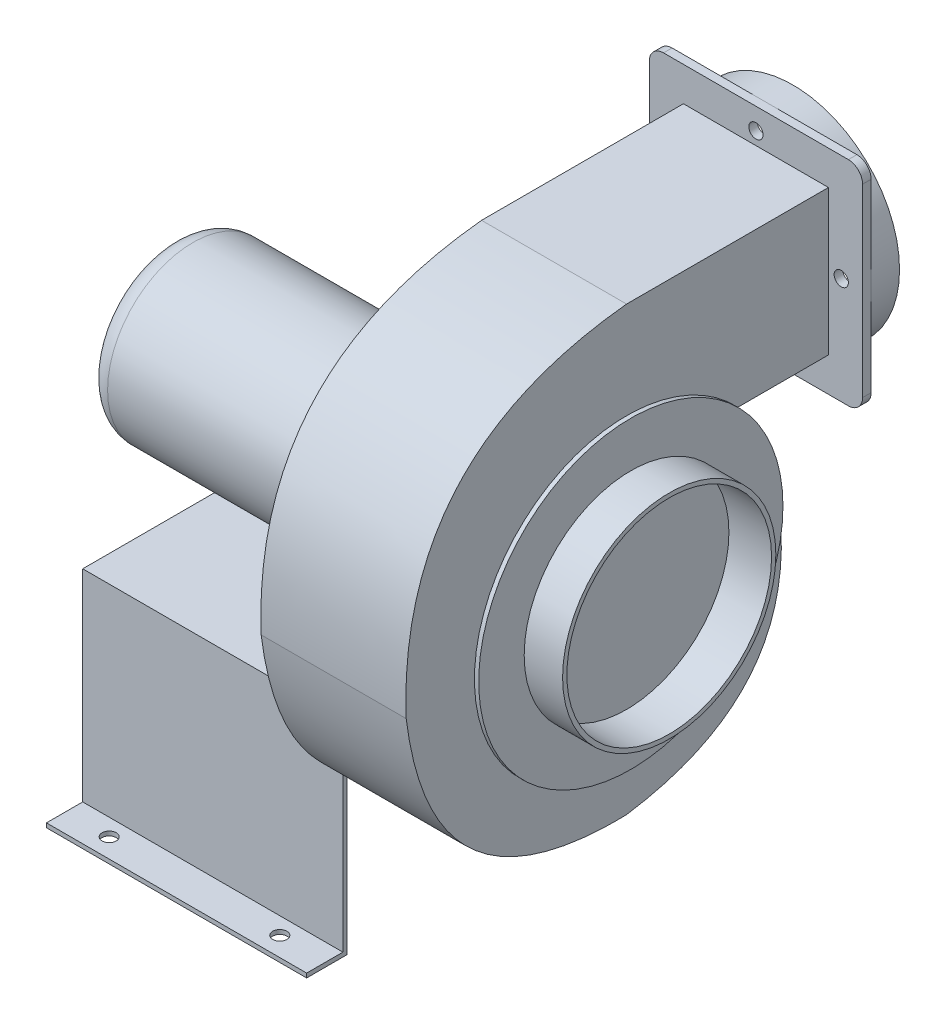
ISO-10303-21;
HEADER;
FILE_DESCRIPTION(('STEP AP214'),'2;1');
FILE_NAME('part.step','',(''),(''),'','','');
FILE_SCHEMA(('AUTOMOTIVE_DESIGN { 1 0 10303 214 1 1 1 1 }'));
ENDSEC;
DATA;
#1=APPLICATION_CONTEXT('core data for automotive mechanical design processes');
#2=APPLICATION_PROTOCOL_DEFINITION('international standard','automotive_design',2000,#1);
#3=PRODUCT_CONTEXT('',#1,'mechanical');
#4=PRODUCT('Part','Part','',(#3));
#5=PRODUCT_RELATED_PRODUCT_CATEGORY('part','',(#4));
#6=PRODUCT_DEFINITION_FORMATION('','',#4);
#7=PRODUCT_DEFINITION_CONTEXT('part definition',#1,'design');
#8=PRODUCT_DEFINITION('design','',#6,#7);
#9=PRODUCT_DEFINITION_SHAPE('','',#8);
#10=(LENGTH_UNIT() NAMED_UNIT(*) SI_UNIT(.MILLI.,.METRE.));
#11=(NAMED_UNIT(*) PLANE_ANGLE_UNIT() SI_UNIT($,.RADIAN.));
#12=(NAMED_UNIT(*) SI_UNIT($,.STERADIAN.) SOLID_ANGLE_UNIT());
#13=UNCERTAINTY_MEASURE_WITH_UNIT(LENGTH_MEASURE(1.E-05),#10,'distance_accuracy_value','');
#14=(GEOMETRIC_REPRESENTATION_CONTEXT(3) GLOBAL_UNCERTAINTY_ASSIGNED_CONTEXT((#13)) GLOBAL_UNIT_ASSIGNED_CONTEXT((#10,
#11,#12)) REPRESENTATION_CONTEXT('',''));
#15=CARTESIAN_POINT('',(0.,0.,0.));
#16=DIRECTION('',(0.,0.,1.));
#17=DIRECTION('',(1.,0.,0.));
#18=AXIS2_PLACEMENT_3D('',#15,#16,#17);
#19=CARTESIAN_POINT('',(-218.,0.,0.));
#20=DIRECTION('',(1.,0.,0.));
#21=DIRECTION('',(0.,0.,-1.));
#22=AXIS2_PLACEMENT_3D('',#19,#20,#21);
#23=CYLINDRICAL_SURFACE('',#22,60.);
#24=CARTESIAN_POINT('',(-203.,0.,0.));
#25=DIRECTION('',(-1.,0.,0.));
#26=DIRECTION('',(0.,0.,1.));
#27=AXIS2_PLACEMENT_3D('',#24,#25,#26);
#28=CIRCLE('',#27,60.);
#29=CARTESIAN_POINT('',(-203.,0.,60.));
#30=VERTEX_POINT('',#29);
#31=EDGE_CURVE('E11',#30,#30,#28,.F.);
#32=ORIENTED_EDGE('',*,*,#31,.T.);
#33=EDGE_LOOP('',(#32));
#34=FACE_BOUND('',#33,.T.);
#35=CARTESIAN_POINT('',(0.,0.,0.));
#36=DIRECTION('',(-1.,0.,0.));
#37=DIRECTION('',(0.,0.,1.));
#38=AXIS2_PLACEMENT_3D('',#35,#36,#37);
#39=CIRCLE('',#38,60.);
#40=CARTESIAN_POINT('',(0.,0.,60.));
#41=VERTEX_POINT('',#40);
#42=EDGE_CURVE('E54',#41,#41,#39,.T.);
#43=ORIENTED_EDGE('',*,*,#42,.T.);
#44=EDGE_LOOP('',(#43));
#45=FACE_BOUND('',#44,.T.);
#46=ADVANCED_FACE('F43',(#34,#45),#23,.T.);
#47=CARTESIAN_POINT('',(-218.,0.,0.));
#48=DIRECTION('',(-1.,0.,0.));
#49=DIRECTION('',(0.,0.,1.));
#50=AXIS2_PLACEMENT_3D('',#47,#48,#49);
#51=PLANE('',#50);
#52=CARTESIAN_POINT('',(-218.,0.,0.));
#53=DIRECTION('',(-1.,0.,0.));
#54=DIRECTION('',(0.,0.,1.));
#55=AXIS2_PLACEMENT_3D('',#52,#53,#54);
#56=CIRCLE('',#55,45.);
#57=CARTESIAN_POINT('',(-218.,0.,45.));
#58=VERTEX_POINT('',#57);
#59=EDGE_CURVE('E50',#58,#58,#56,.T.);
#60=ORIENTED_EDGE('',*,*,#59,.T.);
#61=EDGE_LOOP('',(#60));
#62=FACE_BOUND('',#61,.T.);
#63=ADVANCED_FACE('F64',(#62),#51,.T.);
#64=CARTESIAN_POINT('',(0.,0.,0.));
#65=DIRECTION('',(-1.,0.,0.));
#66=DIRECTION('',(0.,0.,1.));
#67=AXIS2_PLACEMENT_3D('',#64,#65,#66);
#68=PLANE('',#67);
#69=ORIENTED_EDGE('',*,*,#42,.F.);
#70=EDGE_LOOP('',(#69));
#71=FACE_BOUND('',#70,.T.);
#72=ADVANCED_FACE('F62',(#71),#68,.F.);
#73=CARTESIAN_POINT('',(-203.,0.,0.));
#74=DIRECTION('',(-1.,0.,0.));
#75=DIRECTION('',(0.,0.,1.));
#76=AXIS2_PLACEMENT_3D('',#73,#74,#75);
#77=TOROIDAL_SURFACE('',#76,45.,15.);
#78=ORIENTED_EDGE('',*,*,#31,.F.);
#79=EDGE_LOOP('',(#78));
#80=FACE_BOUND('',#79,.T.);
#81=ORIENTED_EDGE('',*,*,#59,.F.);
#82=EDGE_LOOP('',(#81));
#83=FACE_BOUND('',#82,.T.);
#84=ADVANCED_FACE('F45',(#80,#83),#77,.T.);
#85=CLOSED_SHELL('',(#46,#63,#72,#84));
#86=MANIFOLD_SOLID_BREP('B2',#85);
#87=CARTESIAN_POINT('',(0.,0.,0.));
#88=DIRECTION('',(1.,0.,0.));
#89=DIRECTION('',(0.,0.,-1.));
#90=AXIS2_PLACEMENT_3D('',#87,#88,#89);
#91=PLANE('',#90);
#92=DIRECTION('',(0.,1.,0.));
#93=VECTOR('',#92,1.);
#94=CARTESIAN_POINT('',(0.,0.,97.5));
#95=LINE('',#94,#93);
#96=CARTESIAN_POINT('',(0.,-111.50912613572,97.5000000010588));
#97=VERTEX_POINT('',#96);
#98=CARTESIAN_POINT('',(0.,-80.,97.5));
#99=VERTEX_POINT('',#98);
#100=EDGE_CURVE('E41',#97,#99,#95,.T.);
#101=ORIENTED_EDGE('',*,*,#100,.F.);
#102=CARTESIAN_POINT('',(0.,0.,155.));
#103=CARTESIAN_POINT('',(0.,-139.427360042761,137.390163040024));
#104=CARTESIAN_POINT('',(0.,-136.,0.));
#105=B_SPLINE_CURVE_WITH_KNOTS('',2,(#102,#103,#104),.UNSPECIFIED.,.F.,.F.,(3,3),(0.,1.),.UNSPECIFIED.);
#106=CARTESIAN_POINT('',(0.,0.,155.));
#107=VERTEX_POINT('',#106);
#108=EDGE_CURVE('E579',#107,#97,#105,.T.);
#109=ORIENTED_EDGE('',*,*,#108,.F.);
#110=CARTESIAN_POINT('',(0.,175.,0.));
#111=CARTESIAN_POINT('',(0.,158.26886645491,161.023794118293));
#112=CARTESIAN_POINT('',(0.,0.,155.));
#113=B_SPLINE_CURVE_WITH_KNOTS('',2,(#110,#111,#112),.UNSPECIFIED.,.F.,.F.,(3,3),(0.,1.),.UNSPECIFIED.);
#114=CARTESIAN_POINT('',(0.,175.,0.));
#115=VERTEX_POINT('',#114);
#116=EDGE_CURVE('E574',#115,#107,#113,.T.);
#117=ORIENTED_EDGE('',*,*,#116,.F.);
#118=DIRECTION('',(0.,0.,1.));
#119=VECTOR('',#118,1.);
#120=CARTESIAN_POINT('',(0.,175.,0.));
#121=LINE('',#120,#119);
#122=CARTESIAN_POINT('',(0.,175.,-142.));
#123=VERTEX_POINT('',#122);
#124=EDGE_CURVE('E572',#123,#115,#121,.T.);
#125=ORIENTED_EDGE('',*,*,#124,.F.);
#126=DIRECTION('',(0.,1.,0.));
#127=VECTOR('',#126,1.);
#128=CARTESIAN_POINT('',(0.,175.,-142.));
#129=LINE('',#128,#127);
#130=CARTESIAN_POINT('',(0.,73.0000000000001,-142.));
#131=VERTEX_POINT('',#130);
#132=EDGE_CURVE('E569',#131,#123,#129,.T.);
#133=ORIENTED_EDGE('',*,*,#132,.F.);
#134=DIRECTION('',(0.,0.,-1.));
#135=VECTOR('',#134,1.);
#136=CARTESIAN_POINT('',(0.,73.0000000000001,-142.));
#137=LINE('',#136,#135);
#138=CARTESIAN_POINT('',(0.,73.0000000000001,-78.2304288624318));
#139=VERTEX_POINT('',#138);
#140=EDGE_CURVE('E567',#139,#131,#137,.T.);
#141=ORIENTED_EDGE('',*,*,#140,.F.);
#142=CARTESIAN_POINT('',(0.,0.,0.));
#143=DIRECTION('',(1.,0.,0.));
#144=DIRECTION('',(0.,0.,-1.));
#145=AXIS2_PLACEMENT_3D('',#142,#143,#144);
#146=CIRCLE('',#145,107.);
#147=CARTESIAN_POINT('',(0.,0.,-107.));
#148=VERTEX_POINT('',#147);
#149=EDGE_CURVE('E502',#148,#139,#146,.T.);
#150=ORIENTED_EDGE('',*,*,#149,.F.);
#151=CARTESIAN_POINT('',(0.,-136.,0.));
#152=CARTESIAN_POINT('',(0.,-117.699949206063,-123.163257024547));
#153=CARTESIAN_POINT('',(0.,0.,-107.));
#154=B_SPLINE_CURVE_WITH_KNOTS('',2,(#151,#152,#153),.UNSPECIFIED.,.F.,.F.,(3,3),(0.,1.),.UNSPECIFIED.);
#155=CARTESIAN_POINT('',(0.,-80.0000000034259,-96.7288822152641));
#156=VERTEX_POINT('',#155);
#157=EDGE_CURVE('E587',#156,#148,#154,.T.);
#158=ORIENTED_EDGE('',*,*,#157,.F.);
#159=DIRECTION('',(0.,0.,-1.));
#160=VECTOR('',#159,1.);
#161=CARTESIAN_POINT('',(0.,-80.,-97.5));
#162=LINE('',#161,#160);
#163=EDGE_CURVE('E114',#99,#156,#162,.T.);
#164=ORIENTED_EDGE('',*,*,#163,.F.);
#165=EDGE_LOOP('',(#101,#109,#117,#125,#133,#141,#150,#158,#164));
#166=FACE_BOUND('',#165,.T.);
#167=ADVANCED_FACE('F99',(#166),#91,.F.);
#168=DIRECTION('',(0.,1.,0.));
#169=VECTOR('',#168,1.);
#170=CARTESIAN_POINT('',(0.,0.,-94.5));
#171=LINE('',#170,#169);
#172=CARTESIAN_POINT('',(0.,-83.920055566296,-94.500000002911));
#173=VERTEX_POINT('',#172);
#174=CARTESIAN_POINT('',(0.,-83.,-94.5));
#175=VERTEX_POINT('',#174);
#176=EDGE_CURVE('E107',#173,#175,#171,.T.);
#177=ORIENTED_EDGE('',*,*,#176,.F.);
#178=CARTESIAN_POINT('',(0.,-136.,0.));
#179=VERTEX_POINT('',#178);
#180=EDGE_CURVE('E506',#179,#173,#154,.T.);
#181=ORIENTED_EDGE('',*,*,#180,.F.);
#182=CARTESIAN_POINT('',(0.,-113.53515034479,94.5));
#183=VERTEX_POINT('',#182);
#184=EDGE_CURVE('E578',#183,#179,#105,.T.);
#185=ORIENTED_EDGE('',*,*,#184,.F.);
#186=DIRECTION('',(0.,-1.,0.));
#187=VECTOR('',#186,1.);
#188=CARTESIAN_POINT('',(0.,-83.,94.5));
#189=LINE('',#188,#187);
#190=CARTESIAN_POINT('',(0.,-83.,94.5));
#191=VERTEX_POINT('',#190);
#192=EDGE_CURVE('E1286',#191,#183,#189,.T.);
#193=ORIENTED_EDGE('',*,*,#192,.F.);
#194=DIRECTION('',(0.,0.,1.));
#195=VECTOR('',#194,1.);
#196=CARTESIAN_POINT('',(0.,-83.,-94.5));
#197=LINE('',#196,#195);
#198=EDGE_CURVE('E121',#175,#191,#197,.T.);
#199=ORIENTED_EDGE('',*,*,#198,.F.);
#200=EDGE_LOOP('',(#177,#181,#185,#193,#199));
#201=FACE_BOUND('',#200,.T.);
#202=ADVANCED_FACE('F543',(#201),#91,.F.);
#203=CARTESIAN_POINT('',(102.,0.,0.));
#204=DIRECTION('',(1.,0.,0.));
#205=DIRECTION('',(0.,0.,-1.));
#206=AXIS2_PLACEMENT_3D('',#203,#204,#205);
#207=PLANE('',#206);
#208=CARTESIAN_POINT('',(102.,-136.,0.));
#209=CARTESIAN_POINT('',(102.,-117.699949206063,-123.163257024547));
#210=CARTESIAN_POINT('',(102.,0.,-107.));
#211=B_SPLINE_CURVE_WITH_KNOTS('',2,(#208,#209,#210),.UNSPECIFIED.,.F.,.F.,(3,3),(0.,1.),.UNSPECIFIED.);
#212=CARTESIAN_POINT('',(102.,-136.,0.));
#213=VERTEX_POINT('',#212);
#214=CARTESIAN_POINT('',(102.,0.,-107.));
#215=VERTEX_POINT('',#214);
#216=EDGE_CURVE('E556',#213,#215,#211,.T.);
#217=ORIENTED_EDGE('',*,*,#216,.T.);
#218=CARTESIAN_POINT('',(102.,0.,0.));
#219=DIRECTION('',(1.,0.,0.));
#220=DIRECTION('',(0.,0.,-1.));
#221=AXIS2_PLACEMENT_3D('',#218,#219,#220);
#222=CIRCLE('',#221,107.);
#223=CARTESIAN_POINT('',(102.,73.0000000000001,-78.2304288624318));
#224=VERTEX_POINT('',#223);
#225=EDGE_CURVE('E620',#215,#224,#222,.F.);
#226=ORIENTED_EDGE('',*,*,#225,.T.);
#227=DIRECTION('',(0.,0.,-1.));
#228=VECTOR('',#227,1.);
#229=CARTESIAN_POINT('',(102.,73.0000000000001,-142.));
#230=LINE('',#229,#228);
#231=CARTESIAN_POINT('',(102.,73.0000000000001,-142.));
#232=VERTEX_POINT('',#231);
#233=EDGE_CURVE('E503',#224,#232,#230,.T.);
#234=ORIENTED_EDGE('',*,*,#233,.T.);
#235=DIRECTION('',(0.,1.,0.));
#236=VECTOR('',#235,1.);
#237=CARTESIAN_POINT('',(102.,175.,-142.));
#238=LINE('',#237,#236);
#239=CARTESIAN_POINT('',(102.,175.,-142.));
#240=VERTEX_POINT('',#239);
#241=EDGE_CURVE('E505',#232,#240,#238,.T.);
#242=ORIENTED_EDGE('',*,*,#241,.T.);
#243=DIRECTION('',(0.,0.,1.));
#244=VECTOR('',#243,1.);
#245=CARTESIAN_POINT('',(102.,175.,0.));
#246=LINE('',#245,#244);
#247=CARTESIAN_POINT('',(102.,175.,0.));
#248=VERTEX_POINT('',#247);
#249=EDGE_CURVE('E508',#240,#248,#246,.T.);
#250=ORIENTED_EDGE('',*,*,#249,.T.);
#251=CARTESIAN_POINT('',(102.,175.,0.));
#252=CARTESIAN_POINT('',(102.,158.26886645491,161.023794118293));
#253=CARTESIAN_POINT('',(102.,0.,155.));
#254=B_SPLINE_CURVE_WITH_KNOTS('',2,(#251,#252,#253),.UNSPECIFIED.,.F.,.F.,(3,3),(0.,1.),.UNSPECIFIED.);
#255=CARTESIAN_POINT('',(102.,0.,155.));
#256=VERTEX_POINT('',#255);
#257=EDGE_CURVE('E510',#248,#256,#254,.T.);
#258=ORIENTED_EDGE('',*,*,#257,.T.);
#259=CARTESIAN_POINT('',(102.,0.,155.));
#260=CARTESIAN_POINT('',(102.,-139.427360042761,137.390163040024));
#261=CARTESIAN_POINT('',(102.,-136.,0.));
#262=B_SPLINE_CURVE_WITH_KNOTS('',2,(#259,#260,#261),.UNSPECIFIED.,.F.,.F.,(3,3),(0.,1.),.UNSPECIFIED.);
#263=EDGE_CURVE('E515',#256,#213,#262,.T.);
#264=ORIENTED_EDGE('',*,*,#263,.T.);
#265=EDGE_LOOP('',(#217,#226,#234,#242,#250,#258,#264));
#266=FACE_BOUND('',#265,.T.);
#267=ADVANCED_FACE('F548',(#266),#207,.T.);
#268=CARTESIAN_POINT('',(-14.,189.,-148.));
#269=DIRECTION('',(0.,0.,1.));
#270=DIRECTION('',(1.,0.,0.));
#271=AXIS2_PLACEMENT_3D('',#268,#269,#270);
#272=PLANE('',#271);
#273=CARTESIAN_POINT('',(51.,124.,-148.));
#274=DIRECTION('',(0.,0.,-1.));
#275=DIRECTION('',(-1.,0.,0.));
#276=AXIS2_PLACEMENT_3D('',#273,#274,#275);
#277=CIRCLE('',#276,75.);
#278=CARTESIAN_POINT('',(-24.,124.,-148.));
#279=VERTEX_POINT('',#278);
#280=CARTESIAN_POINT('',(51.,199.,-148.));
#281=VERTEX_POINT('',#280);
#282=EDGE_CURVE('E427',#279,#281,#277,.T.);
#283=ORIENTED_EDGE('',*,*,#282,.F.);
#284=DIRECTION('',(0.,1.,0.));
#285=VECTOR('',#284,1.);
#286=CARTESIAN_POINT('',(-24.,59.0000000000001,-148.));
#287=LINE('',#286,#285);
#288=CARTESIAN_POINT('',(-24.,189.,-148.));
#289=VERTEX_POINT('',#288);
#290=EDGE_CURVE('E460',#279,#289,#287,.T.);
#291=ORIENTED_EDGE('',*,*,#290,.T.);
#292=CARTESIAN_POINT('',(-14.,189.,-148.));
#293=DIRECTION('',(0.,0.,-1.));
#294=DIRECTION('',(1.,0.,0.));
#295=AXIS2_PLACEMENT_3D('',#292,#293,#294);
#296=CIRCLE('',#295,10.);
#297=CARTESIAN_POINT('',(-13.9999999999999,199.,-148.));
#298=VERTEX_POINT('',#297);
#299=EDGE_CURVE('E438',#289,#298,#296,.T.);
#300=ORIENTED_EDGE('',*,*,#299,.T.);
#301=DIRECTION('',(1.,0.,0.));
#302=VECTOR('',#301,1.);
#303=CARTESIAN_POINT('',(116.,199.,-148.));
#304=LINE('',#303,#302);
#305=EDGE_CURVE('E443',#298,#281,#304,.T.);
#306=ORIENTED_EDGE('',*,*,#305,.T.);
#307=EDGE_LOOP('',(#283,#291,#300,#306));
#308=FACE_BOUND('',#307,.T.);
#309=ADVANCED_FACE('F740',(#308),#272,.F.);
#310=CARTESIAN_POINT('',(126.,124.,-148.));
#311=VERTEX_POINT('',#310);
#312=EDGE_CURVE('E436',#281,#311,#277,.T.);
#313=ORIENTED_EDGE('',*,*,#312,.F.);
#314=CARTESIAN_POINT('',(116.,199.,-148.));
#315=VERTEX_POINT('',#314);
#316=EDGE_CURVE('E441',#281,#315,#304,.T.);
#317=ORIENTED_EDGE('',*,*,#316,.T.);
#318=CARTESIAN_POINT('',(116.,189.,-148.));
#319=DIRECTION('',(0.,0.,-1.));
#320=DIRECTION('',(1.,0.,0.));
#321=AXIS2_PLACEMENT_3D('',#318,#319,#320);
#322=CIRCLE('',#321,10.);
#323=CARTESIAN_POINT('',(126.,189.,-148.));
#324=VERTEX_POINT('',#323);
#325=EDGE_CURVE('E446',#315,#324,#322,.T.);
#326=ORIENTED_EDGE('',*,*,#325,.T.);
#327=DIRECTION('',(0.,-1.,0.));
#328=VECTOR('',#327,1.);
#329=CARTESIAN_POINT('',(126.,59.0000000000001,-148.));
#330=LINE('',#329,#328);
#331=EDGE_CURVE('E449',#324,#311,#330,.T.);
#332=ORIENTED_EDGE('',*,*,#331,.T.);
#333=EDGE_LOOP('',(#313,#317,#326,#332));
#334=FACE_BOUND('',#333,.T.);
#335=ADVANCED_FACE('F744',(#334),#272,.F.);
#336=CARTESIAN_POINT('',(51.,49.,-148.));
#337=VERTEX_POINT('',#336);
#338=EDGE_CURVE('E785',#311,#337,#277,.T.);
#339=ORIENTED_EDGE('',*,*,#338,.F.);
#340=CARTESIAN_POINT('',(126.,59.0000000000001,-148.));
#341=VERTEX_POINT('',#340);
#342=EDGE_CURVE('E448',#311,#341,#330,.T.);
#343=ORIENTED_EDGE('',*,*,#342,.T.);
#344=CARTESIAN_POINT('',(116.,59.,-148.));
#345=DIRECTION('',(0.,0.,-1.));
#346=DIRECTION('',(1.,0.,0.));
#347=AXIS2_PLACEMENT_3D('',#344,#345,#346);
#348=CIRCLE('',#347,9.99999999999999);
#349=CARTESIAN_POINT('',(116.,49.,-148.));
#350=VERTEX_POINT('',#349);
#351=EDGE_CURVE('E452',#341,#350,#348,.T.);
#352=ORIENTED_EDGE('',*,*,#351,.T.);
#353=DIRECTION('',(-1.,0.,0.));
#354=VECTOR('',#353,1.);
#355=CARTESIAN_POINT('',(116.,49.,-148.));
#356=LINE('',#355,#354);
#357=EDGE_CURVE('E455',#350,#337,#356,.T.);
#358=ORIENTED_EDGE('',*,*,#357,.T.);
#359=EDGE_LOOP('',(#339,#343,#352,#358));
#360=FACE_BOUND('',#359,.T.);
#361=ADVANCED_FACE('F751',(#360),#272,.F.);
#362=EDGE_CURVE('E437',#337,#279,#277,.T.);
#363=ORIENTED_EDGE('',*,*,#362,.F.);
#364=CARTESIAN_POINT('',(-13.9999999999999,49.,-148.));
#365=VERTEX_POINT('',#364);
#366=EDGE_CURVE('E454',#337,#365,#356,.T.);
#367=ORIENTED_EDGE('',*,*,#366,.T.);
#368=CARTESIAN_POINT('',(-14.,59.,-148.));
#369=DIRECTION('',(0.,0.,-1.));
#370=DIRECTION('',(-1.,0.,0.));
#371=AXIS2_PLACEMENT_3D('',#368,#369,#370);
#372=CIRCLE('',#371,10.);
#373=CARTESIAN_POINT('',(-24.,59.0000000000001,-148.));
#374=VERTEX_POINT('',#373);
#375=EDGE_CURVE('E458',#365,#374,#372,.T.);
#376=ORIENTED_EDGE('',*,*,#375,.T.);
#377=EDGE_CURVE('E461',#374,#279,#287,.T.);
#378=ORIENTED_EDGE('',*,*,#377,.T.);
#379=EDGE_LOOP('',(#363,#367,#376,#378));
#380=FACE_BOUND('',#379,.T.);
#381=ADVANCED_FACE('F540',(#380),#272,.F.);
#382=CARTESIAN_POINT('',(102.,0.,0.));
#383=DIRECTION('',(-1.,0.,0.));
#384=DIRECTION('',(0.,0.,1.));
#385=AXIS2_PLACEMENT_3D('',#382,#383,#384);
#386=CYLINDRICAL_SURFACE('',#385,107.);
#387=ORIENTED_EDGE('',*,*,#149,.T.);
#388=DIRECTION('',(-1.,0.,0.));
#389=VECTOR('',#388,1.);
#390=CARTESIAN_POINT('',(102.,73.0000000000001,-78.2304288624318));
#391=LINE('',#390,#389);
#392=EDGE_CURVE('E617',#224,#139,#391,.T.);
#393=ORIENTED_EDGE('',*,*,#392,.F.);
#394=ORIENTED_EDGE('',*,*,#225,.F.);
#395=DIRECTION('',(-1.,0.,0.));
#396=VECTOR('',#395,1.);
#397=CARTESIAN_POINT('',(102.,0.,-107.));
#398=LINE('',#397,#396);
#399=EDGE_CURVE('E561',#215,#148,#398,.T.);
#400=ORIENTED_EDGE('',*,*,#399,.T.);
#401=EDGE_LOOP('',(#387,#393,#394,#400));
#402=FACE_BOUND('',#401,.T.);
#403=CARTESIAN_POINT('',(105.,0.,0.));
#404=DIRECTION('',(1.,0.,0.));
#405=DIRECTION('',(0.,0.,-1.));
#406=AXIS2_PLACEMENT_3D('',#403,#404,#405);
#407=CIRCLE('',#406,107.);
#408=CARTESIAN_POINT('',(105.,0.,-107.));
#409=VERTEX_POINT('',#408);
#410=EDGE_CURVE('E364',#409,#409,#407,.T.);
#411=ORIENTED_EDGE('',*,*,#410,.F.);
#412=EDGE_LOOP('',(#411));
#413=FACE_BOUND('',#412,.T.);
#414=ADVANCED_FACE('F101',(#402,#413),#386,.T.);
#415=CARTESIAN_POINT('',(102.,73.0000000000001,-142.));
#416=DIRECTION('',(0.,1.,0.));
#417=DIRECTION('',(0.,0.,1.));
#418=AXIS2_PLACEMENT_3D('',#415,#416,#417);
#419=PLANE('',#418);
#420=ORIENTED_EDGE('',*,*,#140,.T.);
#421=DIRECTION('',(-1.,0.,0.));
#422=VECTOR('',#421,1.);
#423=CARTESIAN_POINT('',(102.,73.0000000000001,-142.));
#424=LINE('',#423,#422);
#425=EDGE_CURVE('E614',#232,#131,#424,.T.);
#426=ORIENTED_EDGE('',*,*,#425,.F.);
#427=ORIENTED_EDGE('',*,*,#233,.F.);
#428=ORIENTED_EDGE('',*,*,#392,.T.);
#429=EDGE_LOOP('',(#420,#426,#427,#428));
#430=FACE_BOUND('',#429,.T.);
#431=ADVANCED_FACE('F533',(#430),#419,.F.);
#432=CARTESIAN_POINT('',(102.,175.,0.));
#433=DIRECTION('',(0.,-1.,0.));
#434=DIRECTION('',(0.,0.,-1.));
#435=AXIS2_PLACEMENT_3D('',#432,#433,#434);
#436=PLANE('',#435);
#437=ORIENTED_EDGE('',*,*,#124,.T.);
#438=DIRECTION('',(-1.,0.,0.));
#439=VECTOR('',#438,1.);
#440=CARTESIAN_POINT('',(102.,175.,0.));
#441=LINE('',#440,#439);
#442=EDGE_CURVE('E608',#248,#115,#441,.T.);
#443=ORIENTED_EDGE('',*,*,#442,.F.);
#444=ORIENTED_EDGE('',*,*,#249,.F.);
#445=DIRECTION('',(-1.,0.,0.));
#446=VECTOR('',#445,1.);
#447=CARTESIAN_POINT('',(102.,175.,-142.));
#448=LINE('',#447,#446);
#449=EDGE_CURVE('E611',#240,#123,#448,.T.);
#450=ORIENTED_EDGE('',*,*,#449,.T.);
#451=EDGE_LOOP('',(#437,#443,#444,#450));
#452=FACE_BOUND('',#451,.T.);
#453=ADVANCED_FACE('F529',(#452),#436,.F.);
#454=DIRECTION('',(-1.,0.,0.));
#455=VECTOR('',#454,1.);
#456=SURFACE_OF_LINEAR_EXTRUSION('',#254,#455);
#457=ORIENTED_EDGE('',*,*,#116,.T.);
#458=DIRECTION('',(-1.,0.,0.));
#459=VECTOR('',#458,1.);
#460=CARTESIAN_POINT('',(102.,0.,155.));
#461=LINE('',#460,#459);
#462=EDGE_CURVE('E605',#256,#107,#461,.T.);
#463=ORIENTED_EDGE('',*,*,#462,.F.);
#464=ORIENTED_EDGE('',*,*,#257,.F.);
#465=ORIENTED_EDGE('',*,*,#442,.T.);
#466=EDGE_LOOP('',(#457,#463,#464,#465));
#467=FACE_BOUND('',#466,.T.);
#468=ADVANCED_FACE('F524',(#467),#456,.F.);
#469=DIRECTION('',(-1.,0.,0.));
#470=VECTOR('',#469,1.);
#471=SURFACE_OF_LINEAR_EXTRUSION('',#262,#470);
#472=ORIENTED_EDGE('',*,*,#108,.T.);
#473=EDGE_CURVE('E588',#97,#183,#105,.T.);
#474=ORIENTED_EDGE('',*,*,#473,.T.);
#475=ORIENTED_EDGE('',*,*,#184,.T.);
#476=DIRECTION('',(-1.,0.,0.));
#477=VECTOR('',#476,1.);
#478=CARTESIAN_POINT('',(102.,-136.,0.));
#479=LINE('',#478,#477);
#480=EDGE_CURVE('E602',#213,#179,#479,.T.);
#481=ORIENTED_EDGE('',*,*,#480,.F.);
#482=ORIENTED_EDGE('',*,*,#263,.F.);
#483=ORIENTED_EDGE('',*,*,#462,.T.);
#484=EDGE_LOOP('',(#472,#474,#475,#481,#482,#483));
#485=FACE_BOUND('',#484,.T.);
#486=ADVANCED_FACE('F528',(#485),#471,.F.);
#487=DIRECTION('',(-1.,0.,0.));
#488=VECTOR('',#487,1.);
#489=SURFACE_OF_LINEAR_EXTRUSION('',#211,#488);
#490=ORIENTED_EDGE('',*,*,#180,.T.);
#491=EDGE_CURVE('E596',#173,#156,#154,.T.);
#492=ORIENTED_EDGE('',*,*,#491,.T.);
#493=ORIENTED_EDGE('',*,*,#157,.T.);
#494=ORIENTED_EDGE('',*,*,#399,.F.);
#495=ORIENTED_EDGE('',*,*,#216,.F.);
#496=ORIENTED_EDGE('',*,*,#480,.T.);
#497=EDGE_LOOP('',(#490,#492,#493,#494,#495,#496));
#498=FACE_BOUND('',#497,.T.);
#499=ADVANCED_FACE('F552',(#498),#489,.F.);
#500=CARTESIAN_POINT('',(-14.,189.,-148.));
#501=DIRECTION('',(0.,0.,1.));
#502=DIRECTION('',(1.,0.,0.));
#503=AXIS2_PLACEMENT_3D('',#500,#501,#502);
#504=CYLINDRICAL_SURFACE('',#503,10.);
#505=CARTESIAN_POINT('',(-14.,189.,-142.));
#506=DIRECTION('',(0.,0.,-1.));
#507=DIRECTION('',(1.,0.,0.));
#508=AXIS2_PLACEMENT_3D('',#505,#506,#507);
#509=CIRCLE('',#508,10.);
#510=CARTESIAN_POINT('',(-24.,189.,-142.));
#511=VERTEX_POINT('',#510);
#512=CARTESIAN_POINT('',(-13.9999999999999,199.,-142.));
#513=VERTEX_POINT('',#512);
#514=EDGE_CURVE('E433',#511,#513,#509,.T.);
#515=ORIENTED_EDGE('',*,*,#514,.T.);
#516=DIRECTION('',(0.,0.,1.));
#517=VECTOR('',#516,1.);
#518=CARTESIAN_POINT('',(-13.9999999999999,199.,-148.));
#519=LINE('',#518,#517);
#520=EDGE_CURVE('E499',#298,#513,#519,.T.);
#521=ORIENTED_EDGE('',*,*,#520,.F.);
#522=ORIENTED_EDGE('',*,*,#299,.F.);
#523=DIRECTION('',(0.,0.,1.));
#524=VECTOR('',#523,1.);
#525=CARTESIAN_POINT('',(-24.,189.,-148.));
#526=LINE('',#525,#524);
#527=EDGE_CURVE('E463',#289,#511,#526,.T.);
#528=ORIENTED_EDGE('',*,*,#527,.T.);
#529=EDGE_LOOP('',(#515,#521,#522,#528));
#530=FACE_BOUND('',#529,.T.);
#531=ADVANCED_FACE('F554',(#530),#504,.T.);
#532=CARTESIAN_POINT('',(116.,199.,-148.));
#533=DIRECTION('',(0.,-1.,0.));
#534=DIRECTION('',(0.,0.,-1.));
#535=AXIS2_PLACEMENT_3D('',#532,#533,#534);
#536=PLANE('',#535);
#537=DIRECTION('',(1.,0.,0.));
#538=VECTOR('',#537,1.);
#539=CARTESIAN_POINT('',(116.,199.,-142.));
#540=LINE('',#539,#538);
#541=CARTESIAN_POINT('',(116.,199.,-142.));
#542=VERTEX_POINT('',#541);
#543=EDGE_CURVE('E466',#513,#542,#540,.T.);
#544=ORIENTED_EDGE('',*,*,#543,.T.);
#545=DIRECTION('',(0.,0.,1.));
#546=VECTOR('',#545,1.);
#547=CARTESIAN_POINT('',(116.,199.,-148.));
#548=LINE('',#547,#546);
#549=EDGE_CURVE('E496',#315,#542,#548,.T.);
#550=ORIENTED_EDGE('',*,*,#549,.F.);
#551=ORIENTED_EDGE('',*,*,#316,.F.);
#552=ORIENTED_EDGE('',*,*,#305,.F.);
#553=ORIENTED_EDGE('',*,*,#520,.T.);
#554=EDGE_LOOP('',(#544,#550,#551,#552,#553));
#555=FACE_BOUND('',#554,.T.);
#556=ADVANCED_FACE('F798',(#555),#536,.F.);
#557=CARTESIAN_POINT('',(116.,189.,-148.));
#558=DIRECTION('',(0.,0.,1.));
#559=DIRECTION('',(1.,0.,0.));
#560=AXIS2_PLACEMENT_3D('',#557,#558,#559);
#561=CYLINDRICAL_SURFACE('',#560,10.);
#562=CARTESIAN_POINT('',(116.,189.,-142.));
#563=DIRECTION('',(0.,0.,-1.));
#564=DIRECTION('',(1.,0.,0.));
#565=AXIS2_PLACEMENT_3D('',#562,#563,#564);
#566=CIRCLE('',#565,10.);
#567=CARTESIAN_POINT('',(126.,189.,-142.));
#568=VERTEX_POINT('',#567);
#569=EDGE_CURVE('E468',#542,#568,#566,.T.);
#570=ORIENTED_EDGE('',*,*,#569,.T.);
#571=DIRECTION('',(0.,0.,1.));
#572=VECTOR('',#571,1.);
#573=CARTESIAN_POINT('',(126.,189.,-148.));
#574=LINE('',#573,#572);
#575=EDGE_CURVE('E493',#324,#568,#574,.T.);
#576=ORIENTED_EDGE('',*,*,#575,.F.);
#577=ORIENTED_EDGE('',*,*,#325,.F.);
#578=ORIENTED_EDGE('',*,*,#549,.T.);
#579=EDGE_LOOP('',(#570,#576,#577,#578));
#580=FACE_BOUND('',#579,.T.);
#581=ADVANCED_FACE('F807',(#580),#561,.T.);
#582=CARTESIAN_POINT('',(126.,59.0000000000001,-148.));
#583=DIRECTION('',(-1.,0.,0.));
#584=DIRECTION('',(0.,0.,1.));
#585=AXIS2_PLACEMENT_3D('',#582,#583,#584);
#586=PLANE('',#585);
#587=DIRECTION('',(0.,-1.,0.));
#588=VECTOR('',#587,1.);
#589=CARTESIAN_POINT('',(126.,59.0000000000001,-142.));
#590=LINE('',#589,#588);
#591=CARTESIAN_POINT('',(126.,59.0000000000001,-142.));
#592=VERTEX_POINT('',#591);
#593=EDGE_CURVE('E470',#568,#592,#590,.T.);
#594=ORIENTED_EDGE('',*,*,#593,.T.);
#595=DIRECTION('',(0.,0.,1.));
#596=VECTOR('',#595,1.);
#597=CARTESIAN_POINT('',(126.,59.0000000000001,-148.));
#598=LINE('',#597,#596);
#599=EDGE_CURVE('E490',#341,#592,#598,.T.);
#600=ORIENTED_EDGE('',*,*,#599,.F.);
#601=ORIENTED_EDGE('',*,*,#342,.F.);
#602=ORIENTED_EDGE('',*,*,#331,.F.);
#603=ORIENTED_EDGE('',*,*,#575,.T.);
#604=EDGE_LOOP('',(#594,#600,#601,#602,#603));
#605=FACE_BOUND('',#604,.T.);
#606=ADVANCED_FACE('F814',(#605),#586,.F.);
#607=CARTESIAN_POINT('',(116.,59.,-148.));
#608=DIRECTION('',(0.,0.,1.));
#609=DIRECTION('',(1.,0.,0.));
#610=AXIS2_PLACEMENT_3D('',#607,#608,#609);
#611=CYLINDRICAL_SURFACE('',#610,9.99999999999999);
#612=CARTESIAN_POINT('',(116.,59.,-142.));
#613=DIRECTION('',(0.,0.,-1.));
#614=DIRECTION('',(1.,0.,0.));
#615=AXIS2_PLACEMENT_3D('',#612,#613,#614);
#616=CIRCLE('',#615,9.99999999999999);
#617=CARTESIAN_POINT('',(116.,49.,-142.));
#618=VERTEX_POINT('',#617);
#619=EDGE_CURVE('E472',#592,#618,#616,.T.);
#620=ORIENTED_EDGE('',*,*,#619,.T.);
#621=DIRECTION('',(0.,0.,1.));
#622=VECTOR('',#621,1.);
#623=CARTESIAN_POINT('',(116.,49.,-148.));
#624=LINE('',#623,#622);
#625=EDGE_CURVE('E487',#350,#618,#624,.T.);
#626=ORIENTED_EDGE('',*,*,#625,.F.);
#627=ORIENTED_EDGE('',*,*,#351,.F.);
#628=ORIENTED_EDGE('',*,*,#599,.T.);
#629=EDGE_LOOP('',(#620,#626,#627,#628));
#630=FACE_BOUND('',#629,.T.);
#631=ADVANCED_FACE('F816',(#630),#611,.T.);
#632=CARTESIAN_POINT('',(116.,49.,-148.));
#633=DIRECTION('',(0.,1.,0.));
#634=DIRECTION('',(0.,0.,1.));
#635=AXIS2_PLACEMENT_3D('',#632,#633,#634);
#636=PLANE('',#635);
#637=DIRECTION('',(-1.,0.,0.));
#638=VECTOR('',#637,1.);
#639=CARTESIAN_POINT('',(116.,49.,-142.));
#640=LINE('',#639,#638);
#641=CARTESIAN_POINT('',(-13.9999999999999,49.,-142.));
#642=VERTEX_POINT('',#641);
#643=EDGE_CURVE('E474',#618,#642,#640,.T.);
#644=ORIENTED_EDGE('',*,*,#643,.T.);
#645=DIRECTION('',(0.,0.,1.));
#646=VECTOR('',#645,1.);
#647=CARTESIAN_POINT('',(-13.9999999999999,49.,-148.));
#648=LINE('',#647,#646);
#649=EDGE_CURVE('E484',#365,#642,#648,.T.);
#650=ORIENTED_EDGE('',*,*,#649,.F.);
#651=ORIENTED_EDGE('',*,*,#366,.F.);
#652=ORIENTED_EDGE('',*,*,#357,.F.);
#653=ORIENTED_EDGE('',*,*,#625,.T.);
#654=EDGE_LOOP('',(#644,#650,#651,#652,#653));
#655=FACE_BOUND('',#654,.T.);
#656=ADVANCED_FACE('F788',(#655),#636,.F.);
#657=CARTESIAN_POINT('',(-14.,59.,-148.));
#658=DIRECTION('',(0.,0.,1.));
#659=DIRECTION('',(1.,0.,0.));
#660=AXIS2_PLACEMENT_3D('',#657,#658,#659);
#661=CYLINDRICAL_SURFACE('',#660,10.);
#662=CARTESIAN_POINT('',(-14.,59.,-142.));
#663=DIRECTION('',(0.,0.,-1.));
#664=DIRECTION('',(-1.,0.,0.));
#665=AXIS2_PLACEMENT_3D('',#662,#663,#664);
#666=CIRCLE('',#665,10.);
#667=CARTESIAN_POINT('',(-24.,59.0000000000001,-142.));
#668=VERTEX_POINT('',#667);
#669=EDGE_CURVE('E476',#642,#668,#666,.T.);
#670=ORIENTED_EDGE('',*,*,#669,.T.);
#671=DIRECTION('',(0.,0.,1.));
#672=VECTOR('',#671,1.);
#673=CARTESIAN_POINT('',(-24.,59.0000000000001,-148.));
#674=LINE('',#673,#672);
#675=EDGE_CURVE('E481',#374,#668,#674,.T.);
#676=ORIENTED_EDGE('',*,*,#675,.F.);
#677=ORIENTED_EDGE('',*,*,#375,.F.);
#678=ORIENTED_EDGE('',*,*,#649,.T.);
#679=EDGE_LOOP('',(#670,#676,#677,#678));
#680=FACE_BOUND('',#679,.T.);
#681=ADVANCED_FACE('F821',(#680),#661,.T.);
#682=CARTESIAN_POINT('',(-24.,59.0000000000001,-148.));
#683=DIRECTION('',(1.,0.,0.));
#684=DIRECTION('',(0.,0.,-1.));
#685=AXIS2_PLACEMENT_3D('',#682,#683,#684);
#686=PLANE('',#685);
#687=DIRECTION('',(0.,1.,0.));
#688=VECTOR('',#687,1.);
#689=CARTESIAN_POINT('',(-24.,59.0000000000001,-142.));
#690=LINE('',#689,#688);
#691=EDGE_CURVE('E442',#668,#511,#690,.T.);
#692=ORIENTED_EDGE('',*,*,#691,.T.);
#693=ORIENTED_EDGE('',*,*,#527,.F.);
#694=ORIENTED_EDGE('',*,*,#290,.F.);
#695=ORIENTED_EDGE('',*,*,#377,.F.);
#696=ORIENTED_EDGE('',*,*,#675,.T.);
#697=EDGE_LOOP('',(#692,#693,#694,#695,#696));
#698=FACE_BOUND('',#697,.T.);
#699=ADVANCED_FACE('F823',(#698),#686,.F.);
#700=CARTESIAN_POINT('',(-14.,189.,-142.));
#701=DIRECTION('',(0.,0.,1.));
#702=DIRECTION('',(1.,0.,0.));
#703=AXIS2_PLACEMENT_3D('',#700,#701,#702);
#704=PLANE('',#703);
#705=CARTESIAN_POINT('',(51.,64.0000000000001,-142.));
#706=DIRECTION('',(0.,0.,-1.));
#707=DIRECTION('',(-1.,0.,0.));
#708=AXIS2_PLACEMENT_3D('',#705,#706,#707);
#709=CIRCLE('',#708,5.);
#710=CARTESIAN_POINT('',(46.,64.0000000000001,-142.));
#711=VERTEX_POINT('',#710);
#712=EDGE_CURVE('E368',#711,#711,#709,.T.);
#713=ORIENTED_EDGE('',*,*,#712,.T.);
#714=EDGE_LOOP('',(#713));
#715=FACE_BOUND('',#714,.T.);
#716=CARTESIAN_POINT('',(-8.99999999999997,124.,-142.));
#717=DIRECTION('',(0.,0.,-1.));
#718=DIRECTION('',(-1.,0.,0.));
#719=AXIS2_PLACEMENT_3D('',#716,#717,#718);
#720=CIRCLE('',#719,5.);
#721=CARTESIAN_POINT('',(-14.,124.,-142.));
#722=VERTEX_POINT('',#721);
#723=EDGE_CURVE('E374',#722,#722,#720,.T.);
#724=ORIENTED_EDGE('',*,*,#723,.T.);
#725=EDGE_LOOP('',(#724));
#726=FACE_BOUND('',#725,.T.);
#727=CARTESIAN_POINT('',(111.,124.,-142.));
#728=DIRECTION('',(0.,0.,-1.));
#729=DIRECTION('',(-1.,0.,0.));
#730=AXIS2_PLACEMENT_3D('',#727,#728,#729);
#731=CIRCLE('',#730,5.00000000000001);
#732=CARTESIAN_POINT('',(106.,124.,-142.));
#733=VERTEX_POINT('',#732);
#734=EDGE_CURVE('E380',#733,#733,#731,.T.);
#735=ORIENTED_EDGE('',*,*,#734,.T.);
#736=EDGE_LOOP('',(#735));
#737=FACE_BOUND('',#736,.T.);
#738=CARTESIAN_POINT('',(51.,184.,-142.));
#739=DIRECTION('',(0.,0.,-1.));
#740=DIRECTION('',(-1.,0.,0.));
#741=AXIS2_PLACEMENT_3D('',#738,#739,#740);
#742=CIRCLE('',#741,5.);
#743=CARTESIAN_POINT('',(46.,184.,-142.));
#744=VERTEX_POINT('',#743);
#745=EDGE_CURVE('E386',#744,#744,#742,.T.);
#746=ORIENTED_EDGE('',*,*,#745,.T.);
#747=EDGE_LOOP('',(#746));
#748=FACE_BOUND('',#747,.T.);
#749=ORIENTED_EDGE('',*,*,#449,.F.);
#750=ORIENTED_EDGE('',*,*,#241,.F.);
#751=ORIENTED_EDGE('',*,*,#425,.T.);
#752=ORIENTED_EDGE('',*,*,#132,.T.);
#753=EDGE_LOOP('',(#749,#750,#751,#752));
#754=FACE_BOUND('',#753,.T.);
#755=ORIENTED_EDGE('',*,*,#514,.F.);
#756=ORIENTED_EDGE('',*,*,#691,.F.);
#757=ORIENTED_EDGE('',*,*,#669,.F.);
#758=ORIENTED_EDGE('',*,*,#643,.F.);
#759=ORIENTED_EDGE('',*,*,#619,.F.);
#760=ORIENTED_EDGE('',*,*,#593,.F.);
#761=ORIENTED_EDGE('',*,*,#569,.F.);
#762=ORIENTED_EDGE('',*,*,#543,.F.);
#763=EDGE_LOOP('',(#755,#756,#757,#758,#759,#760,#761,#762));
#764=FACE_BOUND('',#763,.T.);
#765=ADVANCED_FACE('F700',(#715,#726,#737,#748,#754,#764),#704,.T.);
#766=CARTESIAN_POINT('',(51.,124.,-168.));
#767=DIRECTION('',(0.,0.,-1.));
#768=DIRECTION('',(-1.,0.,0.));
#769=AXIS2_PLACEMENT_3D('',#766,#767,#768);
#770=PLANE('',#769);
#771=CARTESIAN_POINT('',(51.,124.,-168.));
#772=DIRECTION('',(0.,0.,-1.));
#773=DIRECTION('',(-1.,0.,0.));
#774=AXIS2_PLACEMENT_3D('',#771,#772,#773);
#775=CIRCLE('',#774,75.);
#776=CARTESIAN_POINT('',(-24.,124.,-168.));
#777=VERTEX_POINT('',#776);
#778=EDGE_CURVE('E430',#777,#777,#775,.T.);
#779=ORIENTED_EDGE('',*,*,#778,.T.);
#780=EDGE_LOOP('',(#779));
#781=FACE_BOUND('',#780,.T.);
#782=CARTESIAN_POINT('',(51.,124.,-168.));
#783=DIRECTION('',(0.,0.,-1.));
#784=DIRECTION('',(-1.,0.,0.));
#785=AXIS2_PLACEMENT_3D('',#782,#783,#784);
#786=CIRCLE('',#785,72.);
#787=CARTESIAN_POINT('',(-21.,124.,-168.));
#788=VERTEX_POINT('',#787);
#789=EDGE_CURVE('E424',#788,#788,#786,.T.);
#790=ORIENTED_EDGE('',*,*,#789,.F.);
#791=EDGE_LOOP('',(#790));
#792=FACE_BOUND('',#791,.T.);
#793=ADVANCED_FACE('F830',(#781,#792),#770,.T.);
#794=CARTESIAN_POINT('',(51.,124.,-168.));
#795=DIRECTION('',(0.,0.,1.));
#796=DIRECTION('',(1.,0.,0.));
#797=AXIS2_PLACEMENT_3D('',#794,#795,#796);
#798=CYLINDRICAL_SURFACE('',#797,75.);
#799=ORIENTED_EDGE('',*,*,#778,.F.);
#800=EDGE_LOOP('',(#799));
#801=FACE_BOUND('',#800,.T.);
#802=ORIENTED_EDGE('',*,*,#282,.T.);
#803=ORIENTED_EDGE('',*,*,#312,.T.);
#804=ORIENTED_EDGE('',*,*,#338,.T.);
#805=ORIENTED_EDGE('',*,*,#362,.T.);
#806=EDGE_LOOP('',(#802,#803,#804,#805));
#807=FACE_BOUND('',#806,.T.);
#808=ADVANCED_FACE('F767',(#801,#807),#798,.T.);
#809=CARTESIAN_POINT('',(51.,124.,-168.));
#810=DIRECTION('',(0.,0.,1.));
#811=DIRECTION('',(1.,0.,0.));
#812=AXIS2_PLACEMENT_3D('',#809,#810,#811);
#813=CYLINDRICAL_SURFACE('',#812,72.);
#814=ORIENTED_EDGE('',*,*,#789,.T.);
#815=EDGE_LOOP('',(#814));
#816=FACE_BOUND('',#815,.T.);
#817=CARTESIAN_POINT('',(51.,124.,-148.));
#818=DIRECTION('',(0.,0.,-1.));
#819=DIRECTION('',(-1.,0.,0.));
#820=AXIS2_PLACEMENT_3D('',#817,#818,#819);
#821=CIRCLE('',#820,72.);
#822=CARTESIAN_POINT('',(-21.,124.,-148.));
#823=VERTEX_POINT('',#822);
#824=EDGE_CURVE('E417',#823,#823,#821,.T.);
#825=ORIENTED_EDGE('',*,*,#824,.F.);
#826=EDGE_LOOP('',(#825));
#827=FACE_BOUND('',#826,.T.);
#828=ADVANCED_FACE('F758',(#816,#827),#813,.F.);
#829=CARTESIAN_POINT('',(51.,64.0000000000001,-148.));
#830=DIRECTION('',(0.,0.,-1.));
#831=DIRECTION('',(-1.,0.,0.));
#832=AXIS2_PLACEMENT_3D('',#829,#830,#831);
#833=CIRCLE('',#832,5.);
#834=CARTESIAN_POINT('',(46.,64.0000000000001,-148.));
#835=VERTEX_POINT('',#834);
#836=EDGE_CURVE('E367',#835,#835,#833,.T.);
#837=ORIENTED_EDGE('',*,*,#836,.F.);
#838=EDGE_LOOP('',(#837));
#839=FACE_BOUND('',#838,.T.);
#840=CARTESIAN_POINT('',(-8.99999999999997,124.,-148.));
#841=DIRECTION('',(0.,0.,-1.));
#842=DIRECTION('',(-1.,0.,0.));
#843=AXIS2_PLACEMENT_3D('',#840,#841,#842);
#844=CIRCLE('',#843,5.);
#845=CARTESIAN_POINT('',(-14.,124.,-148.));
#846=VERTEX_POINT('',#845);
#847=EDGE_CURVE('E371',#846,#846,#844,.T.);
#848=ORIENTED_EDGE('',*,*,#847,.F.);
#849=EDGE_LOOP('',(#848));
#850=FACE_BOUND('',#849,.T.);
#851=CARTESIAN_POINT('',(111.,124.,-148.));
#852=DIRECTION('',(0.,0.,-1.));
#853=DIRECTION('',(-1.,0.,0.));
#854=AXIS2_PLACEMENT_3D('',#851,#852,#853);
#855=CIRCLE('',#854,5.00000000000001);
#856=CARTESIAN_POINT('',(106.,124.,-148.));
#857=VERTEX_POINT('',#856);
#858=EDGE_CURVE('E377',#857,#857,#855,.T.);
#859=ORIENTED_EDGE('',*,*,#858,.F.);
#860=EDGE_LOOP('',(#859));
#861=FACE_BOUND('',#860,.T.);
#862=CARTESIAN_POINT('',(51.,184.,-148.));
#863=DIRECTION('',(0.,0.,-1.));
#864=DIRECTION('',(-1.,0.,0.));
#865=AXIS2_PLACEMENT_3D('',#862,#863,#864);
#866=CIRCLE('',#865,5.);
#867=CARTESIAN_POINT('',(46.,184.,-148.));
#868=VERTEX_POINT('',#867);
#869=EDGE_CURVE('E383',#868,#868,#866,.T.);
#870=ORIENTED_EDGE('',*,*,#869,.F.);
#871=EDGE_LOOP('',(#870));
#872=FACE_BOUND('',#871,.T.);
#873=DIRECTION('',(1.,0.,0.));
#874=VECTOR('',#873,1.);
#875=CARTESIAN_POINT('',(101.,174.,-148.));
#876=LINE('',#875,#874);
#877=CARTESIAN_POINT('',(1.00000000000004,174.,-148.));
#878=VERTEX_POINT('',#877);
#879=CARTESIAN_POINT('',(101.,174.,-148.));
#880=VERTEX_POINT('',#879);
#881=EDGE_CURVE('E407',#878,#880,#876,.T.);
#882=ORIENTED_EDGE('',*,*,#881,.F.);
#883=DIRECTION('',(0.,1.,0.));
#884=VECTOR('',#883,1.);
#885=CARTESIAN_POINT('',(1.00000000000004,74.0000000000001,-148.));
#886=LINE('',#885,#884);
#887=CARTESIAN_POINT('',(1.00000000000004,74.0000000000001,-148.));
#888=VERTEX_POINT('',#887);
#889=EDGE_CURVE('E389',#888,#878,#886,.T.);
#890=ORIENTED_EDGE('',*,*,#889,.F.);
#891=DIRECTION('',(-1.,0.,0.));
#892=VECTOR('',#891,1.);
#893=CARTESIAN_POINT('',(101.,74.0000000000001,-148.));
#894=LINE('',#893,#892);
#895=CARTESIAN_POINT('',(101.,74.0000000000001,-148.));
#896=VERTEX_POINT('',#895);
#897=EDGE_CURVE('E396',#896,#888,#894,.T.);
#898=ORIENTED_EDGE('',*,*,#897,.F.);
#899=DIRECTION('',(0.,-1.,0.));
#900=VECTOR('',#899,1.);
#901=CARTESIAN_POINT('',(101.,74.0000000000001,-148.));
#902=LINE('',#901,#900);
#903=EDGE_CURVE('E410',#880,#896,#902,.T.);
#904=ORIENTED_EDGE('',*,*,#903,.F.);
#905=EDGE_LOOP('',(#882,#890,#898,#904));
#906=FACE_BOUND('',#905,.T.);
#907=ORIENTED_EDGE('',*,*,#824,.T.);
#908=EDGE_LOOP('',(#907));
#909=FACE_BOUND('',#908,.T.);
#910=ADVANCED_FACE('F747',(#839,#850,#861,#872,#906,#909),#272,.F.);
#911=CARTESIAN_POINT('',(1.00000000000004,74.0000000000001,-18.));
#912=DIRECTION('',(-1.,0.,0.));
#913=DIRECTION('',(0.,0.,1.));
#914=AXIS2_PLACEMENT_3D('',#911,#912,#913);
#915=PLANE('',#914);
#916=ORIENTED_EDGE('',*,*,#889,.T.);
#917=DIRECTION('',(0.,0.,-1.));
#918=VECTOR('',#917,1.);
#919=CARTESIAN_POINT('',(1.00000000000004,174.,-18.));
#920=LINE('',#919,#918);
#921=CARTESIAN_POINT('',(1.00000000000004,174.,-18.));
#922=VERTEX_POINT('',#921);
#923=EDGE_CURVE('E405',#922,#878,#920,.T.);
#924=ORIENTED_EDGE('',*,*,#923,.F.);
#925=DIRECTION('',(0.,1.,0.));
#926=VECTOR('',#925,1.);
#927=CARTESIAN_POINT('',(1.00000000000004,74.0000000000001,-18.));
#928=LINE('',#927,#926);
#929=CARTESIAN_POINT('',(1.00000000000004,74.0000000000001,-18.));
#930=VERTEX_POINT('',#929);
#931=EDGE_CURVE('E392',#930,#922,#928,.T.);
#932=ORIENTED_EDGE('',*,*,#931,.F.);
#933=DIRECTION('',(0.,0.,-1.));
#934=VECTOR('',#933,1.);
#935=CARTESIAN_POINT('',(1.00000000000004,74.0000000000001,-18.));
#936=LINE('',#935,#934);
#937=EDGE_CURVE('E415',#930,#888,#936,.T.);
#938=ORIENTED_EDGE('',*,*,#937,.T.);
#939=EDGE_LOOP('',(#916,#924,#932,#938));
#940=FACE_BOUND('',#939,.T.);
#941=ADVANCED_FACE('F757',(#940),#915,.F.);
#942=CARTESIAN_POINT('',(101.,74.0000000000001,-18.));
#943=DIRECTION('',(0.,-1.,0.));
#944=DIRECTION('',(0.,0.,-1.));
#945=AXIS2_PLACEMENT_3D('',#942,#943,#944);
#946=PLANE('',#945);
#947=ORIENTED_EDGE('',*,*,#897,.T.);
#948=ORIENTED_EDGE('',*,*,#937,.F.);
#949=DIRECTION('',(-1.,0.,0.));
#950=VECTOR('',#949,1.);
#951=CARTESIAN_POINT('',(101.,74.0000000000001,-18.));
#952=LINE('',#951,#950);
#953=CARTESIAN_POINT('',(101.,74.0000000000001,-18.));
#954=VERTEX_POINT('',#953);
#955=EDGE_CURVE('E402',#954,#930,#952,.T.);
#956=ORIENTED_EDGE('',*,*,#955,.F.);
#957=DIRECTION('',(0.,0.,-1.));
#958=VECTOR('',#957,1.);
#959=CARTESIAN_POINT('',(101.,74.0000000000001,-18.));
#960=LINE('',#959,#958);
#961=EDGE_CURVE('E418',#954,#896,#960,.T.);
#962=ORIENTED_EDGE('',*,*,#961,.T.);
#963=EDGE_LOOP('',(#947,#948,#956,#962));
#964=FACE_BOUND('',#963,.T.);
#965=ADVANCED_FACE('F764',(#964),#946,.F.);
#966=CARTESIAN_POINT('',(101.,74.0000000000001,-18.));
#967=DIRECTION('',(1.,0.,0.));
#968=DIRECTION('',(0.,0.,-1.));
#969=AXIS2_PLACEMENT_3D('',#966,#967,#968);
#970=PLANE('',#969);
#971=ORIENTED_EDGE('',*,*,#903,.T.);
#972=ORIENTED_EDGE('',*,*,#961,.F.);
#973=DIRECTION('',(0.,-1.,0.));
#974=VECTOR('',#973,1.);
#975=CARTESIAN_POINT('',(101.,74.0000000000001,-18.));
#976=LINE('',#975,#974);
#977=CARTESIAN_POINT('',(101.,174.,-18.));
#978=VERTEX_POINT('',#977);
#979=EDGE_CURVE('E399',#978,#954,#976,.T.);
#980=ORIENTED_EDGE('',*,*,#979,.F.);
#981=DIRECTION('',(0.,0.,-1.));
#982=VECTOR('',#981,1.);
#983=CARTESIAN_POINT('',(101.,174.,-18.));
#984=LINE('',#983,#982);
#985=EDGE_CURVE('E420',#978,#880,#984,.T.);
#986=ORIENTED_EDGE('',*,*,#985,.T.);
#987=EDGE_LOOP('',(#971,#972,#980,#986));
#988=FACE_BOUND('',#987,.T.);
#989=ADVANCED_FACE('F947',(#988),#970,.F.);
#990=CARTESIAN_POINT('',(101.,174.,-18.));
#991=DIRECTION('',(0.,1.,0.));
#992=DIRECTION('',(0.,0.,1.));
#993=AXIS2_PLACEMENT_3D('',#990,#991,#992);
#994=PLANE('',#993);
#995=ORIENTED_EDGE('',*,*,#881,.T.);
#996=ORIENTED_EDGE('',*,*,#985,.F.);
#997=DIRECTION('',(1.,0.,0.));
#998=VECTOR('',#997,1.);
#999=CARTESIAN_POINT('',(101.,174.,-18.));
#1000=LINE('',#999,#998);
#1001=EDGE_CURVE('E395',#922,#978,#1000,.T.);
#1002=ORIENTED_EDGE('',*,*,#1001,.F.);
#1003=ORIENTED_EDGE('',*,*,#923,.T.);
#1004=EDGE_LOOP('',(#995,#996,#1002,#1003));
#1005=FACE_BOUND('',#1004,.T.);
#1006=ADVANCED_FACE('F957',(#1005),#994,.F.);
#1007=CARTESIAN_POINT('',(0.,0.,-18.));
#1008=DIRECTION('',(0.,0.,1.));
#1009=DIRECTION('',(1.,0.,0.));
#1010=AXIS2_PLACEMENT_3D('',#1007,#1008,#1009);
#1011=PLANE('',#1010);
#1012=ORIENTED_EDGE('',*,*,#931,.T.);
#1013=ORIENTED_EDGE('',*,*,#1001,.T.);
#1014=ORIENTED_EDGE('',*,*,#979,.T.);
#1015=ORIENTED_EDGE('',*,*,#955,.T.);
#1016=EDGE_LOOP('',(#1012,#1013,#1014,#1015));
#1017=FACE_BOUND('',#1016,.T.);
#1018=ADVANCED_FACE('F966',(#1017),#1011,.F.);
#1019=CARTESIAN_POINT('',(51.,184.,-142.));
#1020=DIRECTION('',(0.,0.,-1.));
#1021=DIRECTION('',(-1.,0.,0.));
#1022=AXIS2_PLACEMENT_3D('',#1019,#1020,#1021);
#1023=CYLINDRICAL_SURFACE('',#1022,5.);
#1024=ORIENTED_EDGE('',*,*,#745,.F.);
#1025=EDGE_LOOP('',(#1024));
#1026=FACE_BOUND('',#1025,.T.);
#1027=ORIENTED_EDGE('',*,*,#869,.T.);
#1028=EDGE_LOOP('',(#1027));
#1029=FACE_BOUND('',#1028,.T.);
#1030=ADVANCED_FACE('F975',(#1026,#1029),#1023,.F.);
#1031=CARTESIAN_POINT('',(111.,124.,-142.));
#1032=DIRECTION('',(0.,0.,-1.));
#1033=DIRECTION('',(-1.,0.,0.));
#1034=AXIS2_PLACEMENT_3D('',#1031,#1032,#1033);
#1035=CYLINDRICAL_SURFACE('',#1034,5.00000000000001);
#1036=ORIENTED_EDGE('',*,*,#734,.F.);
#1037=EDGE_LOOP('',(#1036));
#1038=FACE_BOUND('',#1037,.T.);
#1039=ORIENTED_EDGE('',*,*,#858,.T.);
#1040=EDGE_LOOP('',(#1039));
#1041=FACE_BOUND('',#1040,.T.);
#1042=ADVANCED_FACE('F985',(#1038,#1041),#1035,.F.);
#1043=CARTESIAN_POINT('',(-8.99999999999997,124.,-142.));
#1044=DIRECTION('',(0.,0.,-1.));
#1045=DIRECTION('',(-1.,0.,0.));
#1046=AXIS2_PLACEMENT_3D('',#1043,#1044,#1045);
#1047=CYLINDRICAL_SURFACE('',#1046,5.);
#1048=ORIENTED_EDGE('',*,*,#723,.F.);
#1049=EDGE_LOOP('',(#1048));
#1050=FACE_BOUND('',#1049,.T.);
#1051=ORIENTED_EDGE('',*,*,#847,.T.);
#1052=EDGE_LOOP('',(#1051));
#1053=FACE_BOUND('',#1052,.T.);
#1054=ADVANCED_FACE('F992',(#1050,#1053),#1047,.F.);
#1055=CARTESIAN_POINT('',(51.,64.0000000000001,-142.));
#1056=DIRECTION('',(0.,0.,-1.));
#1057=DIRECTION('',(-1.,0.,0.));
#1058=AXIS2_PLACEMENT_3D('',#1055,#1056,#1057);
#1059=CYLINDRICAL_SURFACE('',#1058,5.);
#1060=ORIENTED_EDGE('',*,*,#712,.F.);
#1061=EDGE_LOOP('',(#1060));
#1062=FACE_BOUND('',#1061,.T.);
#1063=ORIENTED_EDGE('',*,*,#836,.T.);
#1064=EDGE_LOOP('',(#1063));
#1065=FACE_BOUND('',#1064,.T.);
#1066=ADVANCED_FACE('F712',(#1062,#1065),#1059,.F.);
#1067=CARTESIAN_POINT('',(105.,0.,0.));
#1068=DIRECTION('',(1.,0.,0.));
#1069=DIRECTION('',(0.,0.,-1.));
#1070=AXIS2_PLACEMENT_3D('',#1067,#1068,#1069);
#1071=PLANE('',#1070);
#1072=ORIENTED_EDGE('',*,*,#410,.T.);
#1073=EDGE_LOOP('',(#1072));
#1074=FACE_BOUND('',#1073,.T.);
#1075=CARTESIAN_POINT('',(105.,0.,0.));
#1076=DIRECTION('',(1.,0.,0.));
#1077=DIRECTION('',(0.,0.,-1.));
#1078=AXIS2_PLACEMENT_3D('',#1075,#1076,#1077);
#1079=CIRCLE('',#1078,75.);
#1080=CARTESIAN_POINT('',(105.,0.,-75.));
#1081=VERTEX_POINT('',#1080);
#1082=EDGE_CURVE('E361',#1081,#1081,#1079,.T.);
#1083=ORIENTED_EDGE('',*,*,#1082,.F.);
#1084=EDGE_LOOP('',(#1083));
#1085=FACE_BOUND('',#1084,.T.);
#1086=ADVANCED_FACE('F708',(#1074,#1085),#1071,.T.);
#1087=CARTESIAN_POINT('',(132.,0.,0.));
#1088=DIRECTION('',(1.,0.,0.));
#1089=DIRECTION('',(0.,0.,-1.));
#1090=AXIS2_PLACEMENT_3D('',#1087,#1088,#1089);
#1091=PLANE('',#1090);
#1092=CARTESIAN_POINT('',(132.,0.,0.));
#1093=DIRECTION('',(1.,0.,0.));
#1094=DIRECTION('',(0.,0.,-1.));
#1095=AXIS2_PLACEMENT_3D('',#1092,#1093,#1094);
#1096=CIRCLE('',#1095,75.);
#1097=CARTESIAN_POINT('',(132.,0.,-75.));
#1098=VERTEX_POINT('',#1097);
#1099=EDGE_CURVE('E353',#1098,#1098,#1096,.T.);
#1100=ORIENTED_EDGE('',*,*,#1099,.T.);
#1101=EDGE_LOOP('',(#1100));
#1102=FACE_BOUND('',#1101,.T.);
#1103=CARTESIAN_POINT('',(132.,0.,0.));
#1104=DIRECTION('',(1.,0.,0.));
#1105=DIRECTION('',(0.,0.,-1.));
#1106=AXIS2_PLACEMENT_3D('',#1103,#1104,#1105);
#1107=CIRCLE('',#1106,72.);
#1108=CARTESIAN_POINT('',(132.,0.,-72.));
#1109=VERTEX_POINT('',#1108);
#1110=EDGE_CURVE('E350',#1109,#1109,#1107,.T.);
#1111=ORIENTED_EDGE('',*,*,#1110,.F.);
#1112=EDGE_LOOP('',(#1111));
#1113=FACE_BOUND('',#1112,.T.);
#1114=ADVANCED_FACE('F711',(#1102,#1113),#1091,.T.);
#1115=CARTESIAN_POINT('',(132.,0.,0.));
#1116=DIRECTION('',(-1.,0.,0.));
#1117=DIRECTION('',(0.,0.,1.));
#1118=AXIS2_PLACEMENT_3D('',#1115,#1116,#1117);
#1119=CYLINDRICAL_SURFACE('',#1118,75.);
#1120=ORIENTED_EDGE('',*,*,#1082,.T.);
#1121=EDGE_LOOP('',(#1120));
#1122=FACE_BOUND('',#1121,.T.);
#1123=ORIENTED_EDGE('',*,*,#1099,.F.);
#1124=EDGE_LOOP('',(#1123));
#1125=FACE_BOUND('',#1124,.T.);
#1126=ADVANCED_FACE('F716',(#1122,#1125),#1119,.T.);
#1127=CARTESIAN_POINT('',(132.,0.,0.));
#1128=DIRECTION('',(-1.,0.,0.));
#1129=DIRECTION('',(0.,0.,1.));
#1130=AXIS2_PLACEMENT_3D('',#1127,#1128,#1129);
#1131=CYLINDRICAL_SURFACE('',#1130,72.);
#1132=ORIENTED_EDGE('',*,*,#1110,.T.);
#1133=EDGE_LOOP('',(#1132));
#1134=FACE_BOUND('',#1133,.T.);
#1135=CARTESIAN_POINT('',(102.,0.,0.));
#1136=DIRECTION('',(1.,0.,0.));
#1137=DIRECTION('',(0.,0.,-1.));
#1138=AXIS2_PLACEMENT_3D('',#1135,#1136,#1137);
#1139=CIRCLE('',#1138,72.);
#1140=CARTESIAN_POINT('',(102.,0.,-72.));
#1141=VERTEX_POINT('',#1140);
#1142=EDGE_CURVE('E623',#1141,#1141,#1139,.F.);
#1143=ORIENTED_EDGE('',*,*,#1142,.T.);
#1144=EDGE_LOOP('',(#1143));
#1145=FACE_BOUND('',#1144,.T.);
#1146=ADVANCED_FACE('F719',(#1134,#1145),#1131,.F.);
#1147=ORIENTED_EDGE('',*,*,#1142,.F.);
#1148=EDGE_LOOP('',(#1147));
#1149=FACE_BOUND('',#1148,.T.);
#1150=ADVANCED_FACE('F550',(#1149),#207,.T.);
#1151=CARTESIAN_POINT('',(0.,0.,0.));
#1152=DIRECTION('',(-1.,0.,0.));
#1153=DIRECTION('',(0.,0.,1.));
#1154=AXIS2_PLACEMENT_3D('',#1151,#1152,#1153);
#1155=PLANE('',#1154);
#1156=CARTESIAN_POINT('',(0.,-225.,94.5));
#1157=VERTEX_POINT('',#1156);
#1158=EDGE_CURVE('E684',#183,#1157,#189,.T.);
#1159=ORIENTED_EDGE('',*,*,#1158,.F.);
#1160=ORIENTED_EDGE('',*,*,#473,.F.);
#1161=DIRECTION('',(0.,1.,0.));
#1162=VECTOR('',#1161,1.);
#1163=CARTESIAN_POINT('',(0.,-80.,97.5));
#1164=LINE('',#1163,#1162);
#1165=CARTESIAN_POINT('',(0.,-222.,97.5));
#1166=VERTEX_POINT('',#1165);
#1167=EDGE_CURVE('E672',#1166,#97,#1164,.T.);
#1168=ORIENTED_EDGE('',*,*,#1167,.F.);
#1169=DIRECTION('',(0.,0.,-1.));
#1170=VECTOR('',#1169,1.);
#1171=CARTESIAN_POINT('',(0.,-222.,123.));
#1172=LINE('',#1171,#1170);
#1173=CARTESIAN_POINT('',(0.,-222.,123.));
#1174=VERTEX_POINT('',#1173);
#1175=EDGE_CURVE('E1271',#1174,#1166,#1172,.T.);
#1176=ORIENTED_EDGE('',*,*,#1175,.F.);
#1177=DIRECTION('',(0.,1.,0.));
#1178=VECTOR('',#1177,1.);
#1179=CARTESIAN_POINT('',(0.,-225.,123.));
#1180=LINE('',#1179,#1178);
#1181=CARTESIAN_POINT('',(0.,-225.,123.));
#1182=VERTEX_POINT('',#1181);
#1183=EDGE_CURVE('E349',#1182,#1174,#1180,.T.);
#1184=ORIENTED_EDGE('',*,*,#1183,.F.);
#1185=DIRECTION('',(0.,0.,1.));
#1186=VECTOR('',#1185,1.);
#1187=CARTESIAN_POINT('',(0.,-225.,94.5));
#1188=LINE('',#1187,#1186);
#1189=EDGE_CURVE('E345',#1157,#1182,#1188,.T.);
#1190=ORIENTED_EDGE('',*,*,#1189,.F.);
#1191=EDGE_LOOP('',(#1159,#1160,#1168,#1176,#1184,#1190));
#1192=FACE_BOUND('',#1191,.T.);
#1193=ADVANCED_FACE('F682',(#1192),#1155,.F.);
#1194=CARTESIAN_POINT('',(0.,-80.,-97.5));
#1195=VERTEX_POINT('',#1194);
#1196=EDGE_CURVE('E1274',#156,#1195,#162,.T.);
#1197=ORIENTED_EDGE('',*,*,#1196,.F.);
#1198=ORIENTED_EDGE('',*,*,#491,.F.);
#1199=DIRECTION('',(0.,1.,0.));
#1200=VECTOR('',#1199,1.);
#1201=CARTESIAN_POINT('',(0.,-225.,-94.5));
#1202=LINE('',#1201,#1200);
#1203=CARTESIAN_POINT('',(0.,-225.,-94.5));
#1204=VERTEX_POINT('',#1203);
#1205=EDGE_CURVE('E635',#1204,#173,#1202,.T.);
#1206=ORIENTED_EDGE('',*,*,#1205,.F.);
#1207=DIRECTION('',(0.,0.,1.));
#1208=VECTOR('',#1207,1.);
#1209=CARTESIAN_POINT('',(0.,-225.,-123.));
#1210=LINE('',#1209,#1208);
#1211=CARTESIAN_POINT('',(0.,-225.,-123.));
#1212=VERTEX_POINT('',#1211);
#1213=EDGE_CURVE('E1282',#1212,#1204,#1210,.T.);
#1214=ORIENTED_EDGE('',*,*,#1213,.F.);
#1215=DIRECTION('',(0.,-1.,0.));
#1216=VECTOR('',#1215,1.);
#1217=CARTESIAN_POINT('',(0.,-222.,-123.));
#1218=LINE('',#1217,#1216);
#1219=CARTESIAN_POINT('',(0.,-222.,-123.));
#1220=VERTEX_POINT('',#1219);
#1221=EDGE_CURVE('E1280',#1220,#1212,#1218,.T.);
#1222=ORIENTED_EDGE('',*,*,#1221,.F.);
#1223=DIRECTION('',(0.,0.,-1.));
#1224=VECTOR('',#1223,1.);
#1225=CARTESIAN_POINT('',(0.,-222.,-97.5));
#1226=LINE('',#1225,#1224);
#1227=CARTESIAN_POINT('',(0.,-222.,-97.5));
#1228=VERTEX_POINT('',#1227);
#1229=EDGE_CURVE('E1278',#1228,#1220,#1226,.T.);
#1230=ORIENTED_EDGE('',*,*,#1229,.F.);
#1231=DIRECTION('',(0.,-1.,0.));
#1232=VECTOR('',#1231,1.);
#1233=CARTESIAN_POINT('',(0.,-80.,-97.5));
#1234=LINE('',#1233,#1232);
#1235=EDGE_CURVE('E1276',#1195,#1228,#1234,.T.);
#1236=ORIENTED_EDGE('',*,*,#1235,.F.);
#1237=EDGE_LOOP('',(#1197,#1198,#1206,#1214,#1222,#1230,#1236));
#1238=FACE_BOUND('',#1237,.T.);
#1239=ADVANCED_FACE('F737',(#1238),#1155,.F.);
#1240=CARTESIAN_POINT('',(-183.,-225.,123.));
#1241=DIRECTION('',(0.,0.,-1.));
#1242=DIRECTION('',(-1.,0.,0.));
#1243=AXIS2_PLACEMENT_3D('',#1240,#1241,#1242);
#1244=PLANE('',#1243);
#1245=ORIENTED_EDGE('',*,*,#1183,.T.);
#1246=DIRECTION('',(1.,0.,0.));
#1247=VECTOR('',#1246,1.);
#1248=CARTESIAN_POINT('',(-183.,-222.,123.));
#1249=LINE('',#1248,#1247);
#1250=CARTESIAN_POINT('',(-183.,-222.,123.));
#1251=VERTEX_POINT('',#1250);
#1252=EDGE_CURVE('E329',#1251,#1174,#1249,.T.);
#1253=ORIENTED_EDGE('',*,*,#1252,.F.);
#1254=DIRECTION('',(0.,1.,0.));
#1255=VECTOR('',#1254,1.);
#1256=CARTESIAN_POINT('',(-183.,-225.,123.));
#1257=LINE('',#1256,#1255);
#1258=CARTESIAN_POINT('',(-183.,-225.,123.));
#1259=VERTEX_POINT('',#1258);
#1260=EDGE_CURVE('E336',#1259,#1251,#1257,.T.);
#1261=ORIENTED_EDGE('',*,*,#1260,.F.);
#1262=DIRECTION('',(1.,0.,0.));
#1263=VECTOR('',#1262,1.);
#1264=CARTESIAN_POINT('',(-183.,-225.,123.));
#1265=LINE('',#1264,#1263);
#1266=EDGE_CURVE('E1269',#1259,#1182,#1265,.T.);
#1267=ORIENTED_EDGE('',*,*,#1266,.T.);
#1268=EDGE_LOOP('',(#1245,#1253,#1261,#1267));
#1269=FACE_BOUND('',#1268,.T.);
#1270=ADVANCED_FACE('F347',(#1269),#1244,.F.);
#1271=CARTESIAN_POINT('',(-183.,-222.,123.));
#1272=DIRECTION('',(0.,-1.,0.));
#1273=DIRECTION('',(0.,0.,-1.));
#1274=AXIS2_PLACEMENT_3D('',#1271,#1272,#1273);
#1275=PLANE('',#1274);
#1276=CARTESIAN_POINT('',(-32.4285186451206,-222.,109.464128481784));
#1277=DIRECTION('',(0.,-1.,0.));
#1278=DIRECTION('',(0.,0.,-1.));
#1279=AXIS2_PLACEMENT_3D('',#1276,#1277,#1278);
#1280=CIRCLE('',#1279,5.);
#1281=CARTESIAN_POINT('',(-32.4285186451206,-222.,104.464128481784));
#1282=VERTEX_POINT('',#1281);
#1283=EDGE_CURVE('E1242',#1282,#1282,#1280,.T.);
#1284=ORIENTED_EDGE('',*,*,#1283,.T.);
#1285=EDGE_LOOP('',(#1284));
#1286=FACE_BOUND('',#1285,.T.);
#1287=CARTESIAN_POINT('',(-152.428518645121,-222.,109.464128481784));
#1288=DIRECTION('',(0.,-1.,0.));
#1289=DIRECTION('',(0.,0.,-1.));
#1290=AXIS2_PLACEMENT_3D('',#1287,#1288,#1289);
#1291=CIRCLE('',#1290,4.99999999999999);
#1292=CARTESIAN_POINT('',(-152.428518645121,-222.,104.464128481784));
#1293=VERTEX_POINT('',#1292);
#1294=EDGE_CURVE('E1248',#1293,#1293,#1291,.T.);
#1295=ORIENTED_EDGE('',*,*,#1294,.T.);
#1296=EDGE_LOOP('',(#1295));
#1297=FACE_BOUND('',#1296,.T.);
#1298=ORIENTED_EDGE('',*,*,#1175,.T.);
#1299=DIRECTION('',(1.,0.,0.));
#1300=VECTOR('',#1299,1.);
#1301=CARTESIAN_POINT('',(-183.,-222.,97.5));
#1302=LINE('',#1301,#1300);
#1303=CARTESIAN_POINT('',(-183.,-222.,97.5));
#1304=VERTEX_POINT('',#1303);
#1305=EDGE_CURVE('E332',#1304,#1166,#1302,.T.);
#1306=ORIENTED_EDGE('',*,*,#1305,.F.);
#1307=DIRECTION('',(0.,0.,-1.));
#1308=VECTOR('',#1307,1.);
#1309=CARTESIAN_POINT('',(-183.,-222.,123.));
#1310=LINE('',#1309,#1308);
#1311=EDGE_CURVE('E325',#1251,#1304,#1310,.T.);
#1312=ORIENTED_EDGE('',*,*,#1311,.F.);
#1313=ORIENTED_EDGE('',*,*,#1252,.T.);
#1314=EDGE_LOOP('',(#1298,#1306,#1312,#1313));
#1315=FACE_BOUND('',#1314,.T.);
#1316=ADVANCED_FACE('F327',(#1286,#1297,#1315),#1275,.F.);
#1317=CARTESIAN_POINT('',(-183.,-80.,97.5));
#1318=DIRECTION('',(0.,0.,-1.));
#1319=DIRECTION('',(-1.,0.,0.));
#1320=AXIS2_PLACEMENT_3D('',#1317,#1318,#1319);
#1321=PLANE('',#1320);
#1322=ORIENTED_EDGE('',*,*,#1167,.T.);
#1323=ORIENTED_EDGE('',*,*,#100,.T.);
#1324=DIRECTION('',(1.,0.,0.));
#1325=VECTOR('',#1324,1.);
#1326=CARTESIAN_POINT('',(-183.,-80.,97.5));
#1327=LINE('',#1326,#1325);
#1328=CARTESIAN_POINT('',(-183.,-80.,97.5));
#1329=VERTEX_POINT('',#1328);
#1330=EDGE_CURVE('E355',#1329,#99,#1327,.T.);
#1331=ORIENTED_EDGE('',*,*,#1330,.F.);
#1332=DIRECTION('',(0.,1.,0.));
#1333=VECTOR('',#1332,1.);
#1334=CARTESIAN_POINT('',(-183.,-80.,97.5));
#1335=LINE('',#1334,#1333);
#1336=EDGE_CURVE('E335',#1304,#1329,#1335,.T.);
#1337=ORIENTED_EDGE('',*,*,#1336,.F.);
#1338=ORIENTED_EDGE('',*,*,#1305,.T.);
#1339=EDGE_LOOP('',(#1322,#1323,#1331,#1337,#1338));
#1340=FACE_BOUND('',#1339,.T.);
#1341=ADVANCED_FACE('F670',(#1340),#1321,.F.);
#1342=CARTESIAN_POINT('',(-183.,-80.,-97.5));
#1343=DIRECTION('',(0.,-1.,0.));
#1344=DIRECTION('',(0.,0.,-1.));
#1345=AXIS2_PLACEMENT_3D('',#1342,#1343,#1344);
#1346=PLANE('',#1345);
#1347=ORIENTED_EDGE('',*,*,#163,.T.);
#1348=ORIENTED_EDGE('',*,*,#1196,.T.);
#1349=DIRECTION('',(1.,0.,0.));
#1350=VECTOR('',#1349,1.);
#1351=CARTESIAN_POINT('',(-183.,-80.,-97.5));
#1352=LINE('',#1351,#1350);
#1353=CARTESIAN_POINT('',(-183.,-80.,-97.5));
#1354=VERTEX_POINT('',#1353);
#1355=EDGE_CURVE('E659',#1354,#1195,#1352,.T.);
#1356=ORIENTED_EDGE('',*,*,#1355,.F.);
#1357=DIRECTION('',(0.,0.,-1.));
#1358=VECTOR('',#1357,1.);
#1359=CARTESIAN_POINT('',(-183.,-80.,-97.5));
#1360=LINE('',#1359,#1358);
#1361=EDGE_CURVE('E667',#1329,#1354,#1360,.T.);
#1362=ORIENTED_EDGE('',*,*,#1361,.F.);
#1363=ORIENTED_EDGE('',*,*,#1330,.T.);
#1364=EDGE_LOOP('',(#1347,#1348,#1356,#1362,#1363));
#1365=FACE_BOUND('',#1364,.T.);
#1366=ADVANCED_FACE('F665',(#1365),#1346,.F.);
#1367=CARTESIAN_POINT('',(-183.,-80.,-97.5));
#1368=DIRECTION('',(0.,0.,1.));
#1369=DIRECTION('',(0.,-1.,0.));
#1370=AXIS2_PLACEMENT_3D('',#1367,#1368,#1369);
#1371=PLANE('',#1370);
#1372=ORIENTED_EDGE('',*,*,#1235,.T.);
#1373=DIRECTION('',(1.,0.,0.));
#1374=VECTOR('',#1373,1.);
#1375=CARTESIAN_POINT('',(-183.,-222.,-97.5));
#1376=LINE('',#1375,#1374);
#1377=CARTESIAN_POINT('',(-183.,-222.,-97.5));
#1378=VERTEX_POINT('',#1377);
#1379=EDGE_CURVE('E656',#1378,#1228,#1376,.T.);
#1380=ORIENTED_EDGE('',*,*,#1379,.F.);
#1381=DIRECTION('',(0.,-1.,0.));
#1382=VECTOR('',#1381,1.);
#1383=CARTESIAN_POINT('',(-183.,-80.,-97.5));
#1384=LINE('',#1383,#1382);
#1385=EDGE_CURVE('E1255',#1354,#1378,#1384,.T.);
#1386=ORIENTED_EDGE('',*,*,#1385,.F.);
#1387=ORIENTED_EDGE('',*,*,#1355,.T.);
#1388=EDGE_LOOP('',(#1372,#1380,#1386,#1387));
#1389=FACE_BOUND('',#1388,.T.);
#1390=ADVANCED_FACE('F1091',(#1389),#1371,.F.);
#1391=CARTESIAN_POINT('',(-183.,-222.,-97.5));
#1392=DIRECTION('',(0.,-1.,0.));
#1393=DIRECTION('',(0.,0.,-1.));
#1394=AXIS2_PLACEMENT_3D('',#1391,#1392,#1393);
#1395=PLANE('',#1394);
#1396=CARTESIAN_POINT('',(-152.428518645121,-222.,-112.535871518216));
#1397=DIRECTION('',(0.,-1.,0.));
#1398=DIRECTION('',(0.,0.,-1.));
#1399=AXIS2_PLACEMENT_3D('',#1396,#1397,#1398);
#1400=CIRCLE('',#1399,4.99999999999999);
#1401=CARTESIAN_POINT('',(-152.428518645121,-222.,-117.535871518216));
#1402=VERTEX_POINT('',#1401);
#1403=EDGE_CURVE('E1228',#1402,#1402,#1400,.T.);
#1404=ORIENTED_EDGE('',*,*,#1403,.T.);
#1405=EDGE_LOOP('',(#1404));
#1406=FACE_BOUND('',#1405,.T.);
#1407=CARTESIAN_POINT('',(-32.4285186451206,-222.,-112.535871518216));
#1408=DIRECTION('',(0.,-1.,0.));
#1409=DIRECTION('',(0.,0.,-1.));
#1410=AXIS2_PLACEMENT_3D('',#1407,#1408,#1409);
#1411=CIRCLE('',#1410,5.);
#1412=CARTESIAN_POINT('',(-32.4285186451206,-222.,-117.535871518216));
#1413=VERTEX_POINT('',#1412);
#1414=EDGE_CURVE('E1236',#1413,#1413,#1411,.T.);
#1415=ORIENTED_EDGE('',*,*,#1414,.T.);
#1416=EDGE_LOOP('',(#1415));
#1417=FACE_BOUND('',#1416,.T.);
#1418=ORIENTED_EDGE('',*,*,#1229,.T.);
#1419=DIRECTION('',(1.,0.,0.));
#1420=VECTOR('',#1419,1.);
#1421=CARTESIAN_POINT('',(-183.,-222.,-123.));
#1422=LINE('',#1421,#1420);
#1423=CARTESIAN_POINT('',(-183.,-222.,-123.));
#1424=VERTEX_POINT('',#1423);
#1425=EDGE_CURVE('E653',#1424,#1220,#1422,.T.);
#1426=ORIENTED_EDGE('',*,*,#1425,.F.);
#1427=DIRECTION('',(0.,0.,-1.));
#1428=VECTOR('',#1427,1.);
#1429=CARTESIAN_POINT('',(-183.,-222.,-97.5));
#1430=LINE('',#1429,#1428);
#1431=EDGE_CURVE('E1257',#1378,#1424,#1430,.T.);
#1432=ORIENTED_EDGE('',*,*,#1431,.F.);
#1433=ORIENTED_EDGE('',*,*,#1379,.T.);
#1434=EDGE_LOOP('',(#1418,#1426,#1432,#1433));
#1435=FACE_BOUND('',#1434,.T.);
#1436=ADVANCED_FACE('F1100',(#1406,#1417,#1435),#1395,.F.);
#1437=CARTESIAN_POINT('',(-183.,-222.,-123.));
#1438=DIRECTION('',(0.,0.,1.));
#1439=DIRECTION('',(1.,0.,0.));
#1440=AXIS2_PLACEMENT_3D('',#1437,#1438,#1439);
#1441=PLANE('',#1440);
#1442=ORIENTED_EDGE('',*,*,#1221,.T.);
#1443=DIRECTION('',(1.,0.,0.));
#1444=VECTOR('',#1443,1.);
#1445=CARTESIAN_POINT('',(-183.,-225.,-123.));
#1446=LINE('',#1445,#1444);
#1447=CARTESIAN_POINT('',(-183.,-225.,-123.));
#1448=VERTEX_POINT('',#1447);
#1449=EDGE_CURVE('E645',#1448,#1212,#1446,.T.);
#1450=ORIENTED_EDGE('',*,*,#1449,.F.);
#1451=DIRECTION('',(0.,-1.,0.));
#1452=VECTOR('',#1451,1.);
#1453=CARTESIAN_POINT('',(-183.,-222.,-123.));
#1454=LINE('',#1453,#1452);
#1455=EDGE_CURVE('E1259',#1424,#1448,#1454,.T.);
#1456=ORIENTED_EDGE('',*,*,#1455,.F.);
#1457=ORIENTED_EDGE('',*,*,#1425,.T.);
#1458=EDGE_LOOP('',(#1442,#1450,#1456,#1457));
#1459=FACE_BOUND('',#1458,.T.);
#1460=ADVANCED_FACE('F1108',(#1459),#1441,.F.);
#1461=CARTESIAN_POINT('',(-183.,-225.,-123.));
#1462=DIRECTION('',(0.,1.,0.));
#1463=DIRECTION('',(0.,0.,1.));
#1464=AXIS2_PLACEMENT_3D('',#1461,#1462,#1463);
#1465=PLANE('',#1464);
#1466=CARTESIAN_POINT('',(-152.428518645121,-225.,-112.535871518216));
#1467=DIRECTION('',(0.,-1.,0.));
#1468=DIRECTION('',(0.,0.,-1.));
#1469=AXIS2_PLACEMENT_3D('',#1466,#1467,#1468);
#1470=CIRCLE('',#1469,4.99999999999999);
#1471=CARTESIAN_POINT('',(-152.428518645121,-225.,-117.535871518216));
#1472=VERTEX_POINT('',#1471);
#1473=EDGE_CURVE('E1231',#1472,#1472,#1470,.T.);
#1474=ORIENTED_EDGE('',*,*,#1473,.F.);
#1475=EDGE_LOOP('',(#1474));
#1476=FACE_BOUND('',#1475,.T.);
#1477=CARTESIAN_POINT('',(-32.4285186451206,-225.,-112.535871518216));
#1478=DIRECTION('',(0.,-1.,0.));
#1479=DIRECTION('',(0.,0.,-1.));
#1480=AXIS2_PLACEMENT_3D('',#1477,#1478,#1479);
#1481=CIRCLE('',#1480,5.);
#1482=CARTESIAN_POINT('',(-32.4285186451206,-225.,-117.535871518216));
#1483=VERTEX_POINT('',#1482);
#1484=EDGE_CURVE('E1233',#1483,#1483,#1481,.T.);
#1485=ORIENTED_EDGE('',*,*,#1484,.F.);
#1486=EDGE_LOOP('',(#1485));
#1487=FACE_BOUND('',#1486,.T.);
#1488=ORIENTED_EDGE('',*,*,#1213,.T.);
#1489=DIRECTION('',(1.,0.,0.));
#1490=VECTOR('',#1489,1.);
#1491=CARTESIAN_POINT('',(-183.,-225.,-94.5));
#1492=LINE('',#1491,#1490);
#1493=CARTESIAN_POINT('',(-183.,-225.,-94.5));
#1494=VERTEX_POINT('',#1493);
#1495=EDGE_CURVE('E642',#1494,#1204,#1492,.T.);
#1496=ORIENTED_EDGE('',*,*,#1495,.F.);
#1497=DIRECTION('',(0.,0.,1.));
#1498=VECTOR('',#1497,1.);
#1499=CARTESIAN_POINT('',(-183.,-225.,-123.));
#1500=LINE('',#1499,#1498);
#1501=EDGE_CURVE('E1261',#1448,#1494,#1500,.T.);
#1502=ORIENTED_EDGE('',*,*,#1501,.F.);
#1503=ORIENTED_EDGE('',*,*,#1449,.T.);
#1504=EDGE_LOOP('',(#1488,#1496,#1502,#1503));
#1505=FACE_BOUND('',#1504,.T.);
#1506=ADVANCED_FACE('F1113',(#1476,#1487,#1505),#1465,.F.);
#1507=CARTESIAN_POINT('',(-183.,-225.,-94.5));
#1508=DIRECTION('',(0.,0.,-1.));
#1509=DIRECTION('',(-1.,0.,0.));
#1510=AXIS2_PLACEMENT_3D('',#1507,#1508,#1509);
#1511=PLANE('',#1510);
#1512=ORIENTED_EDGE('',*,*,#1205,.T.);
#1513=ORIENTED_EDGE('',*,*,#176,.T.);
#1514=DIRECTION('',(1.,0.,0.));
#1515=VECTOR('',#1514,1.);
#1516=CARTESIAN_POINT('',(-183.,-83.,-94.5));
#1517=LINE('',#1516,#1515);
#1518=CARTESIAN_POINT('',(-183.,-83.,-94.5));
#1519=VERTEX_POINT('',#1518);
#1520=EDGE_CURVE('E631',#1519,#175,#1517,.T.);
#1521=ORIENTED_EDGE('',*,*,#1520,.F.);
#1522=DIRECTION('',(0.,1.,0.));
#1523=VECTOR('',#1522,1.);
#1524=CARTESIAN_POINT('',(-183.,-225.,-94.5));
#1525=LINE('',#1524,#1523);
#1526=EDGE_CURVE('E1263',#1494,#1519,#1525,.T.);
#1527=ORIENTED_EDGE('',*,*,#1526,.F.);
#1528=ORIENTED_EDGE('',*,*,#1495,.T.);
#1529=EDGE_LOOP('',(#1512,#1513,#1521,#1527,#1528));
#1530=FACE_BOUND('',#1529,.T.);
#1531=ADVANCED_FACE('F629',(#1530),#1511,.F.);
#1532=CARTESIAN_POINT('',(-183.,-83.,-94.5));
#1533=DIRECTION('',(0.,1.,0.));
#1534=DIRECTION('',(0.,0.,1.));
#1535=AXIS2_PLACEMENT_3D('',#1532,#1533,#1534);
#1536=PLANE('',#1535);
#1537=ORIENTED_EDGE('',*,*,#198,.T.);
#1538=DIRECTION('',(1.,0.,0.));
#1539=VECTOR('',#1538,1.);
#1540=CARTESIAN_POINT('',(-183.,-83.,94.5));
#1541=LINE('',#1540,#1539);
#1542=CARTESIAN_POINT('',(-183.,-83.,94.5));
#1543=VERTEX_POINT('',#1542);
#1544=EDGE_CURVE('E643',#1543,#191,#1541,.T.);
#1545=ORIENTED_EDGE('',*,*,#1544,.F.);
#1546=DIRECTION('',(0.,0.,1.));
#1547=VECTOR('',#1546,1.);
#1548=CARTESIAN_POINT('',(-183.,-83.,-94.5));
#1549=LINE('',#1548,#1547);
#1550=EDGE_CURVE('E641',#1519,#1543,#1549,.T.);
#1551=ORIENTED_EDGE('',*,*,#1550,.F.);
#1552=ORIENTED_EDGE('',*,*,#1520,.T.);
#1553=EDGE_LOOP('',(#1537,#1545,#1551,#1552));
#1554=FACE_BOUND('',#1553,.T.);
#1555=ADVANCED_FACE('F638',(#1554),#1536,.F.);
#1556=CARTESIAN_POINT('',(-183.,-83.,94.5));
#1557=DIRECTION('',(0.,0.,1.));
#1558=DIRECTION('',(1.,0.,0.));
#1559=AXIS2_PLACEMENT_3D('',#1556,#1557,#1558);
#1560=PLANE('',#1559);
#1561=ORIENTED_EDGE('',*,*,#192,.T.);
#1562=ORIENTED_EDGE('',*,*,#1158,.T.);
#1563=DIRECTION('',(1.,0.,0.));
#1564=VECTOR('',#1563,1.);
#1565=CARTESIAN_POINT('',(-183.,-225.,94.5));
#1566=LINE('',#1565,#1564);
#1567=CARTESIAN_POINT('',(-183.,-225.,94.5));
#1568=VERTEX_POINT('',#1567);
#1569=EDGE_CURVE('E647',#1568,#1157,#1566,.T.);
#1570=ORIENTED_EDGE('',*,*,#1569,.F.);
#1571=DIRECTION('',(0.,-1.,0.));
#1572=VECTOR('',#1571,1.);
#1573=CARTESIAN_POINT('',(-183.,-83.,94.5));
#1574=LINE('',#1573,#1572);
#1575=EDGE_CURVE('E1266',#1543,#1568,#1574,.T.);
#1576=ORIENTED_EDGE('',*,*,#1575,.F.);
#1577=ORIENTED_EDGE('',*,*,#1544,.T.);
#1578=EDGE_LOOP('',(#1561,#1562,#1570,#1576,#1577));
#1579=FACE_BOUND('',#1578,.T.);
#1580=ADVANCED_FACE('F1133',(#1579),#1560,.F.);
#1581=CARTESIAN_POINT('',(-183.,-225.,94.5));
#1582=DIRECTION('',(0.,1.,0.));
#1583=DIRECTION('',(0.,0.,1.));
#1584=AXIS2_PLACEMENT_3D('',#1581,#1582,#1583);
#1585=PLANE('',#1584);
#1586=CARTESIAN_POINT('',(-32.4285186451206,-225.,109.464128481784));
#1587=DIRECTION('',(0.,-1.,0.));
#1588=DIRECTION('',(0.,0.,-1.));
#1589=AXIS2_PLACEMENT_3D('',#1586,#1587,#1588);
#1590=CIRCLE('',#1589,5.);
#1591=CARTESIAN_POINT('',(-32.4285186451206,-225.,104.464128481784));
#1592=VERTEX_POINT('',#1591);
#1593=EDGE_CURVE('E1239',#1592,#1592,#1590,.T.);
#1594=ORIENTED_EDGE('',*,*,#1593,.F.);
#1595=EDGE_LOOP('',(#1594));
#1596=FACE_BOUND('',#1595,.T.);
#1597=CARTESIAN_POINT('',(-152.428518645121,-225.,109.464128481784));
#1598=DIRECTION('',(0.,-1.,0.));
#1599=DIRECTION('',(0.,0.,-1.));
#1600=AXIS2_PLACEMENT_3D('',#1597,#1598,#1599);
#1601=CIRCLE('',#1600,4.99999999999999);
#1602=CARTESIAN_POINT('',(-152.428518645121,-225.,104.464128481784));
#1603=VERTEX_POINT('',#1602);
#1604=EDGE_CURVE('E1245',#1603,#1603,#1601,.T.);
#1605=ORIENTED_EDGE('',*,*,#1604,.F.);
#1606=EDGE_LOOP('',(#1605));
#1607=FACE_BOUND('',#1606,.T.);
#1608=ORIENTED_EDGE('',*,*,#1189,.T.);
#1609=ORIENTED_EDGE('',*,*,#1266,.F.);
#1610=DIRECTION('',(0.,0.,1.));
#1611=VECTOR('',#1610,1.);
#1612=CARTESIAN_POINT('',(-183.,-225.,94.5));
#1613=LINE('',#1612,#1611);
#1614=EDGE_CURVE('E341',#1568,#1259,#1613,.T.);
#1615=ORIENTED_EDGE('',*,*,#1614,.F.);
#1616=ORIENTED_EDGE('',*,*,#1569,.T.);
#1617=EDGE_LOOP('',(#1608,#1609,#1615,#1616));
#1618=FACE_BOUND('',#1617,.T.);
#1619=ADVANCED_FACE('F1142',(#1596,#1607,#1618),#1585,.F.);
#1620=CARTESIAN_POINT('',(-183.,0.,0.));
#1621=DIRECTION('',(-1.,0.,0.));
#1622=DIRECTION('',(0.,0.,1.));
#1623=AXIS2_PLACEMENT_3D('',#1620,#1621,#1622);
#1624=PLANE('',#1623);
#1625=ORIENTED_EDGE('',*,*,#1260,.T.);
#1626=ORIENTED_EDGE('',*,*,#1311,.T.);
#1627=ORIENTED_EDGE('',*,*,#1336,.T.);
#1628=ORIENTED_EDGE('',*,*,#1361,.T.);
#1629=ORIENTED_EDGE('',*,*,#1385,.T.);
#1630=ORIENTED_EDGE('',*,*,#1431,.T.);
#1631=ORIENTED_EDGE('',*,*,#1455,.T.);
#1632=ORIENTED_EDGE('',*,*,#1501,.T.);
#1633=ORIENTED_EDGE('',*,*,#1526,.T.);
#1634=ORIENTED_EDGE('',*,*,#1550,.T.);
#1635=ORIENTED_EDGE('',*,*,#1575,.T.);
#1636=ORIENTED_EDGE('',*,*,#1614,.T.);
#1637=EDGE_LOOP('',(#1625,#1626,#1627,#1628,#1629,#1630,#1631,#1632,#1633,#1634,#1635,#1636));
#1638=FACE_BOUND('',#1637,.T.);
#1639=ADVANCED_FACE('F339',(#1638),#1624,.T.);
#1640=CARTESIAN_POINT('',(-152.428518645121,-222.,109.464128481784));
#1641=DIRECTION('',(0.,-1.,0.));
#1642=DIRECTION('',(0.,0.,-1.));
#1643=AXIS2_PLACEMENT_3D('',#1640,#1641,#1642);
#1644=CYLINDRICAL_SURFACE('',#1643,4.99999999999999);
#1645=ORIENTED_EDGE('',*,*,#1294,.F.);
#1646=EDGE_LOOP('',(#1645));
#1647=FACE_BOUND('',#1646,.T.);
#1648=ORIENTED_EDGE('',*,*,#1604,.T.);
#1649=EDGE_LOOP('',(#1648));
#1650=FACE_BOUND('',#1649,.T.);
#1651=ADVANCED_FACE('F1154',(#1647,#1650),#1644,.F.);
#1652=CARTESIAN_POINT('',(-32.4285186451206,-222.,109.464128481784));
#1653=DIRECTION('',(0.,-1.,0.));
#1654=DIRECTION('',(0.,0.,-1.));
#1655=AXIS2_PLACEMENT_3D('',#1652,#1653,#1654);
#1656=CYLINDRICAL_SURFACE('',#1655,5.);
#1657=ORIENTED_EDGE('',*,*,#1283,.F.);
#1658=EDGE_LOOP('',(#1657));
#1659=FACE_BOUND('',#1658,.T.);
#1660=ORIENTED_EDGE('',*,*,#1593,.T.);
#1661=EDGE_LOOP('',(#1660));
#1662=FACE_BOUND('',#1661,.T.);
#1663=ADVANCED_FACE('F1191',(#1659,#1662),#1656,.F.);
#1664=CARTESIAN_POINT('',(-32.4285186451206,-222.,-112.535871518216));
#1665=DIRECTION('',(0.,-1.,0.));
#1666=DIRECTION('',(0.,0.,-1.));
#1667=AXIS2_PLACEMENT_3D('',#1664,#1665,#1666);
#1668=CYLINDRICAL_SURFACE('',#1667,5.);
#1669=ORIENTED_EDGE('',*,*,#1414,.F.);
#1670=EDGE_LOOP('',(#1669));
#1671=FACE_BOUND('',#1670,.T.);
#1672=ORIENTED_EDGE('',*,*,#1484,.T.);
#1673=EDGE_LOOP('',(#1672));
#1674=FACE_BOUND('',#1673,.T.);
#1675=ADVANCED_FACE('F1201',(#1671,#1674),#1668,.F.);
#1676=CARTESIAN_POINT('',(-152.428518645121,-222.,-112.535871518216));
#1677=DIRECTION('',(0.,-1.,0.));
#1678=DIRECTION('',(0.,0.,-1.));
#1679=AXIS2_PLACEMENT_3D('',#1676,#1677,#1678);
#1680=CYLINDRICAL_SURFACE('',#1679,4.99999999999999);
#1681=ORIENTED_EDGE('',*,*,#1403,.F.);
#1682=EDGE_LOOP('',(#1681));
#1683=FACE_BOUND('',#1682,.T.);
#1684=ORIENTED_EDGE('',*,*,#1473,.T.);
#1685=EDGE_LOOP('',(#1684));
#1686=FACE_BOUND('',#1685,.T.);
#1687=ADVANCED_FACE('F1211',(#1683,#1686),#1680,.F.);
#1688=CLOSED_SHELL('',(#167,#202,#267,#309,#335,#361,#381,#414,#431,#453,#468,#486,#499,#531,
#556,#581,#606,#631,#656,#681,#699,#765,#793,#808,#828,#910,#941,#965,#989,#1006,#1018,#1030,
#1042,#1054,#1066,#1086,#1114,#1126,#1146,#1150,#1193,#1239,#1270,#1316,#1341,#1366,#1390,#1436,
#1460,#1506,#1531,#1555,#1580,#1619,#1639,#1651,#1663,#1675,#1687));
#1689=MANIFOLD_SOLID_BREP('B6',#1688);
#1690=ADVANCED_BREP_SHAPE_REPRESENTATION('',(#18,#86,#1689),#14);
#1691=SHAPE_DEFINITION_REPRESENTATION(#9,#1690);
ENDSEC;
END-ISO-10303-21;
